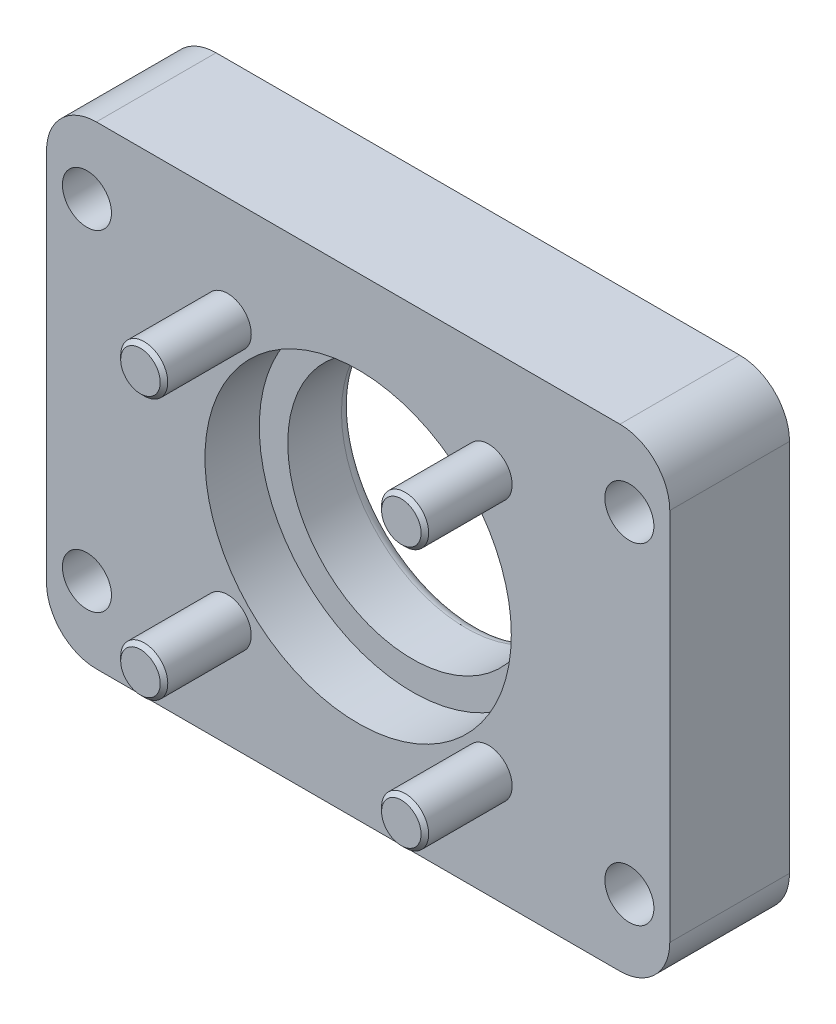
ISO-10303-21;
HEADER;
FILE_DESCRIPTION(('STEP AP214'),'2;1');
FILE_NAME('part.step','',(''),(''),'','','');
FILE_SCHEMA(('AUTOMOTIVE_DESIGN { 1 0 10303 214 1 1 1 1 }'));
ENDSEC;
DATA;
#1=APPLICATION_CONTEXT('core data for automotive mechanical design processes');
#2=APPLICATION_PROTOCOL_DEFINITION('international standard','automotive_design',2000,#1);
#3=PRODUCT_CONTEXT('',#1,'mechanical');
#4=PRODUCT('Part','Part','',(#3));
#5=PRODUCT_RELATED_PRODUCT_CATEGORY('part','',(#4));
#6=PRODUCT_DEFINITION_FORMATION('','',#4);
#7=PRODUCT_DEFINITION_CONTEXT('part definition',#1,'design');
#8=PRODUCT_DEFINITION('design','',#6,#7);
#9=PRODUCT_DEFINITION_SHAPE('','',#8);
#10=(LENGTH_UNIT() NAMED_UNIT(*) SI_UNIT(.MILLI.,.METRE.));
#11=(NAMED_UNIT(*) PLANE_ANGLE_UNIT() SI_UNIT($,.RADIAN.));
#12=(NAMED_UNIT(*) SI_UNIT($,.STERADIAN.) SOLID_ANGLE_UNIT());
#13=UNCERTAINTY_MEASURE_WITH_UNIT(LENGTH_MEASURE(1.E-05),#10,'distance_accuracy_value','');
#14=(GEOMETRIC_REPRESENTATION_CONTEXT(3) GLOBAL_UNCERTAINTY_ASSIGNED_CONTEXT((#13)) GLOBAL_UNIT_ASSIGNED_CONTEXT((#10,
#11,#12)) REPRESENTATION_CONTEXT('',''));
#15=CARTESIAN_POINT('',(0.,0.,0.));
#16=DIRECTION('',(0.,0.,1.));
#17=DIRECTION('',(1.,0.,0.));
#18=AXIS2_PLACEMENT_3D('',#15,#16,#17);
#19=CARTESIAN_POINT('',(33.2340187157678,33.2340187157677,-23.77));
#20=DIRECTION('',(0.,0.,-1.));
#21=DIRECTION('',(0.,1.,0.));
#22=AXIS2_PLACEMENT_3D('',#19,#20,#21);
#23=CONICAL_SURFACE('',#22,5.0575,1.0471975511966);
#24=CARTESIAN_POINT('',(33.2340187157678,33.2340187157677,-20.8500510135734));
#25=VERTEX_POINT('',#24);
#26=VERTEX_LOOP('',#25);
#27=FACE_BOUND('',#26,.T.);
#28=CARTESIAN_POINT('',(33.2340187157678,33.2340187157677,-23.77));
#29=DIRECTION('',(0.,0.,-1.));
#30=DIRECTION('',(0.,1.,0.));
#31=AXIS2_PLACEMENT_3D('',#28,#29,#30);
#32=CIRCLE('',#31,5.0575);
#33=CARTESIAN_POINT('',(33.2340187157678,38.2915187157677,-23.77));
#34=VERTEX_POINT('',#33);
#35=CARTESIAN_POINT('',(37.6139421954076,35.7627687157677,-23.77));
#36=VERTEX_POINT('',#35);
#37=EDGE_CURVE('E959',#34,#36,#32,.T.);
#38=ORIENTED_EDGE('',*,*,#37,.T.);
#39=CARTESIAN_POINT('',(37.6139421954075,30.7052687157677,-23.77));
#40=VERTEX_POINT('',#39);
#41=EDGE_CURVE('E962',#36,#40,#32,.T.);
#42=ORIENTED_EDGE('',*,*,#41,.T.);
#43=CARTESIAN_POINT('',(33.2340187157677,28.1765187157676,-23.77));
#44=VERTEX_POINT('',#43);
#45=EDGE_CURVE('E1276',#40,#44,#32,.T.);
#46=ORIENTED_EDGE('',*,*,#45,.T.);
#47=CARTESIAN_POINT('',(28.854095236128,30.7052687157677,-23.77));
#48=VERTEX_POINT('',#47);
#49=EDGE_CURVE('E1283',#44,#48,#32,.T.);
#50=ORIENTED_EDGE('',*,*,#49,.T.);
#51=CARTESIAN_POINT('',(28.854095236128,35.7627687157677,-23.77));
#52=VERTEX_POINT('',#51);
#53=EDGE_CURVE('E1284',#48,#52,#32,.T.);
#54=ORIENTED_EDGE('',*,*,#53,.T.);
#55=EDGE_CURVE('E963',#52,#34,#32,.T.);
#56=ORIENTED_EDGE('',*,*,#55,.T.);
#57=EDGE_LOOP('',(#38,#42,#46,#50,#54,#56));
#58=FACE_BOUND('',#57,.T.);
#59=ADVANCED_FACE('F16',(#27,#58),#23,.F.);
#60=CARTESIAN_POINT('',(-33.2340187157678,33.2340187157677,-23.77));
#61=DIRECTION('',(0.,0.,-1.));
#62=DIRECTION('',(-1.,0.,0.));
#63=AXIS2_PLACEMENT_3D('',#60,#61,#62);
#64=CONICAL_SURFACE('',#63,5.0575,1.0471975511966);
#65=CARTESIAN_POINT('',(-33.2340187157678,33.2340187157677,-20.8500510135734));
#66=VERTEX_POINT('',#65);
#67=VERTEX_LOOP('',#66);
#68=FACE_BOUND('',#67,.T.);
#69=CARTESIAN_POINT('',(-33.2340187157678,33.2340187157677,-23.77));
#70=DIRECTION('',(0.,0.,-1.));
#71=DIRECTION('',(-1.,0.,0.));
#72=AXIS2_PLACEMENT_3D('',#69,#70,#71);
#73=CIRCLE('',#72,5.0575);
#74=CARTESIAN_POINT('',(-38.2915187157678,33.2340187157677,-23.77));
#75=VERTEX_POINT('',#74);
#76=CARTESIAN_POINT('',(-35.7627687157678,37.6139421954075,-23.77));
#77=VERTEX_POINT('',#76);
#78=EDGE_CURVE('E799',#75,#77,#73,.T.);
#79=ORIENTED_EDGE('',*,*,#78,.T.);
#80=CARTESIAN_POINT('',(-30.7052687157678,37.6139421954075,-23.77));
#81=VERTEX_POINT('',#80);
#82=EDGE_CURVE('E802',#77,#81,#73,.T.);
#83=ORIENTED_EDGE('',*,*,#82,.T.);
#84=CARTESIAN_POINT('',(-28.1765187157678,33.2340187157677,-23.77));
#85=VERTEX_POINT('',#84);
#86=EDGE_CURVE('E2288',#81,#85,#73,.T.);
#87=ORIENTED_EDGE('',*,*,#86,.T.);
#88=CARTESIAN_POINT('',(-30.7052687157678,28.8540952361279,-23.77));
#89=VERTEX_POINT('',#88);
#90=EDGE_CURVE('E2291',#85,#89,#73,.T.);
#91=ORIENTED_EDGE('',*,*,#90,.T.);
#92=CARTESIAN_POINT('',(-35.7627687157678,28.8540952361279,-23.77));
#93=VERTEX_POINT('',#92);
#94=EDGE_CURVE('E2292',#89,#93,#73,.T.);
#95=ORIENTED_EDGE('',*,*,#94,.T.);
#96=EDGE_CURVE('E803',#93,#75,#73,.T.);
#97=ORIENTED_EDGE('',*,*,#96,.T.);
#98=EDGE_LOOP('',(#79,#83,#87,#91,#95,#97));
#99=FACE_BOUND('',#98,.T.);
#100=ADVANCED_FACE('F360',(#68,#99),#64,.F.);
#101=CARTESIAN_POINT('',(-33.234018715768,-33.2340187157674,-23.77));
#102=DIRECTION('',(0.,0.,-1.));
#103=DIRECTION('',(0.,-1.,0.));
#104=AXIS2_PLACEMENT_3D('',#101,#102,#103);
#105=CONICAL_SURFACE('',#104,5.0575,1.0471975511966);
#106=CARTESIAN_POINT('',(-33.234018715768,-33.2340187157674,-20.8500510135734));
#107=VERTEX_POINT('',#106);
#108=VERTEX_LOOP('',#107);
#109=FACE_BOUND('',#108,.T.);
#110=CARTESIAN_POINT('',(-33.234018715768,-33.2340187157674,-23.77));
#111=DIRECTION('',(0.,0.,-1.));
#112=DIRECTION('',(0.,-1.,0.));
#113=AXIS2_PLACEMENT_3D('',#110,#111,#112);
#114=CIRCLE('',#113,5.0575);
#115=CARTESIAN_POINT('',(-33.2340187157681,-38.2915187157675,-23.77));
#116=VERTEX_POINT('',#115);
#117=CARTESIAN_POINT('',(-37.6139421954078,-35.7627687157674,-23.77));
#118=VERTEX_POINT('',#117);
#119=EDGE_CURVE('E879',#116,#118,#114,.T.);
#120=ORIENTED_EDGE('',*,*,#119,.T.);
#121=CARTESIAN_POINT('',(-37.6139421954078,-30.7052687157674,-23.77));
#122=VERTEX_POINT('',#121);
#123=EDGE_CURVE('E882',#118,#122,#114,.T.);
#124=ORIENTED_EDGE('',*,*,#123,.T.);
#125=CARTESIAN_POINT('',(-33.234018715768,-28.1765187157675,-23.77));
#126=VERTEX_POINT('',#125);
#127=EDGE_CURVE('E2255',#122,#126,#114,.T.);
#128=ORIENTED_EDGE('',*,*,#127,.T.);
#129=CARTESIAN_POINT('',(-28.8540952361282,-30.7052687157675,-23.77));
#130=VERTEX_POINT('',#129);
#131=EDGE_CURVE('E2258',#126,#130,#114,.T.);
#132=ORIENTED_EDGE('',*,*,#131,.T.);
#133=CARTESIAN_POINT('',(-28.8540952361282,-35.7627687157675,-23.77));
#134=VERTEX_POINT('',#133);
#135=EDGE_CURVE('E2259',#130,#134,#114,.T.);
#136=ORIENTED_EDGE('',*,*,#135,.T.);
#137=EDGE_CURVE('E883',#134,#116,#114,.T.);
#138=ORIENTED_EDGE('',*,*,#137,.T.);
#139=EDGE_LOOP('',(#120,#124,#128,#132,#136,#138));
#140=FACE_BOUND('',#139,.T.);
#141=ADVANCED_FACE('F367',(#109,#140),#105,.F.);
#142=CARTESIAN_POINT('',(33.2340187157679,43.3490187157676,-23.77));
#143=DIRECTION('',(0.,0.,1.));
#144=DIRECTION('',(0.,-1.,0.));
#145=AXIS2_PLACEMENT_3D('',#142,#143,#144);
#146=PLANE('',#145);
#147=DIRECTION('',(-0.5,-0.866025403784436,0.));
#148=VECTOR('',#147,1.);
#149=CARTESIAN_POINT('',(39.0739166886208,33.2340187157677,-23.77));
#150=LINE('',#149,#148);
#151=CARTESIAN_POINT('',(36.1539677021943,28.1765187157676,-23.77));
#152=VERTEX_POINT('',#151);
#153=EDGE_CURVE('E985',#40,#152,#150,.T.);
#154=ORIENTED_EDGE('',*,*,#153,.T.);
#155=DIRECTION('',(-1.,0.,0.));
#156=VECTOR('',#155,1.);
#157=CARTESIAN_POINT('',(36.1539677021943,28.1765187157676,-23.77));
#158=LINE('',#157,#156);
#159=EDGE_CURVE('E986',#152,#44,#158,.T.);
#160=ORIENTED_EDGE('',*,*,#159,.T.);
#161=ORIENTED_EDGE('',*,*,#45,.F.);
#162=EDGE_LOOP('',(#154,#160,#161));
#163=FACE_BOUND('',#162,.T.);
#164=ADVANCED_FACE('F441',(#163),#146,.F.);
#165=CARTESIAN_POINT('',(30.3140697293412,28.1765187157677,-23.77));
#166=VERTEX_POINT('',#165);
#167=EDGE_CURVE('E988',#44,#166,#158,.T.);
#168=ORIENTED_EDGE('',*,*,#167,.T.);
#169=DIRECTION('',(0.5,-0.866025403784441,0.));
#170=VECTOR('',#169,1.);
#171=CARTESIAN_POINT('',(27.3941207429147,33.2340187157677,-23.77));
#172=LINE('',#171,#170);
#173=EDGE_CURVE('E992',#48,#166,#172,.T.);
#174=ORIENTED_EDGE('',*,*,#173,.F.);
#175=ORIENTED_EDGE('',*,*,#49,.F.);
#176=EDGE_LOOP('',(#168,#174,#175));
#177=FACE_BOUND('',#176,.T.);
#178=ADVANCED_FACE('F1230',(#177),#146,.F.);
#179=CARTESIAN_POINT('',(27.3941207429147,33.2340187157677,-23.77));
#180=VERTEX_POINT('',#179);
#181=EDGE_CURVE('E989',#180,#48,#172,.T.);
#182=ORIENTED_EDGE('',*,*,#181,.F.);
#183=DIRECTION('',(-0.5,-0.866025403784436,0.));
#184=VECTOR('',#183,1.);
#185=CARTESIAN_POINT('',(30.3140697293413,38.2915187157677,-23.77));
#186=LINE('',#185,#184);
#187=EDGE_CURVE('E996',#52,#180,#186,.T.);
#188=ORIENTED_EDGE('',*,*,#187,.F.);
#189=ORIENTED_EDGE('',*,*,#53,.F.);
#190=EDGE_LOOP('',(#182,#188,#189));
#191=FACE_BOUND('',#190,.T.);
#192=ADVANCED_FACE('F1233',(#191),#146,.F.);
#193=CARTESIAN_POINT('',(30.3140697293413,38.2915187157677,-23.77));
#194=VERTEX_POINT('',#193);
#195=EDGE_CURVE('E993',#194,#52,#186,.T.);
#196=ORIENTED_EDGE('',*,*,#195,.F.);
#197=DIRECTION('',(1.,0.,0.));
#198=VECTOR('',#197,1.);
#199=CARTESIAN_POINT('',(30.3140697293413,38.2915187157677,-23.77));
#200=LINE('',#199,#198);
#201=EDGE_CURVE('E997',#194,#34,#200,.T.);
#202=ORIENTED_EDGE('',*,*,#201,.T.);
#203=ORIENTED_EDGE('',*,*,#55,.F.);
#204=EDGE_LOOP('',(#196,#202,#203));
#205=FACE_BOUND('',#204,.T.);
#206=ADVANCED_FACE('F1289',(#205),#146,.F.);
#207=CARTESIAN_POINT('',(36.1539677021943,38.2915187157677,-23.77));
#208=VERTEX_POINT('',#207);
#209=EDGE_CURVE('E1000',#34,#208,#200,.T.);
#210=ORIENTED_EDGE('',*,*,#209,.T.);
#211=DIRECTION('',(-0.5,0.866025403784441,0.));
#212=VECTOR('',#211,1.);
#213=CARTESIAN_POINT('',(39.0739166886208,33.2340187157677,-23.77));
#214=LINE('',#213,#212);
#215=EDGE_CURVE('E1004',#36,#208,#214,.T.);
#216=ORIENTED_EDGE('',*,*,#215,.F.);
#217=ORIENTED_EDGE('',*,*,#37,.F.);
#218=EDGE_LOOP('',(#210,#216,#217));
#219=FACE_BOUND('',#218,.T.);
#220=ADVANCED_FACE('F1300',(#219),#146,.F.);
#221=CARTESIAN_POINT('',(39.0739166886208,33.2340187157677,-23.77));
#222=VERTEX_POINT('',#221);
#223=EDGE_CURVE('E1001',#222,#36,#214,.T.);
#224=ORIENTED_EDGE('',*,*,#223,.F.);
#225=EDGE_CURVE('E982',#222,#40,#150,.T.);
#226=ORIENTED_EDGE('',*,*,#225,.T.);
#227=ORIENTED_EDGE('',*,*,#41,.F.);
#228=EDGE_LOOP('',(#224,#226,#227));
#229=FACE_BOUND('',#228,.T.);
#230=ADVANCED_FACE('F1280',(#229),#146,.F.);
#231=CARTESIAN_POINT('',(-43.3490187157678,33.2340187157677,-23.77));
#232=DIRECTION('',(0.,0.,1.));
#233=DIRECTION('',(1.,0.,0.));
#234=AXIS2_PLACEMENT_3D('',#231,#232,#233);
#235=PLANE('',#234);
#236=DIRECTION('',(0.866025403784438,-0.5,0.));
#237=VECTOR('',#236,1.);
#238=CARTESIAN_POINT('',(-33.2340187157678,39.0739166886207,-23.77));
#239=LINE('',#238,#237);
#240=CARTESIAN_POINT('',(-28.1765187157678,36.1539677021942,-23.77));
#241=VERTEX_POINT('',#240);
#242=EDGE_CURVE('E825',#81,#241,#239,.T.);
#243=ORIENTED_EDGE('',*,*,#242,.T.);
#244=DIRECTION('',(0.,-1.,0.));
#245=VECTOR('',#244,1.);
#246=CARTESIAN_POINT('',(-28.1765187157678,36.1539677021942,-23.77));
#247=LINE('',#246,#245);
#248=EDGE_CURVE('E826',#241,#85,#247,.T.);
#249=ORIENTED_EDGE('',*,*,#248,.T.);
#250=ORIENTED_EDGE('',*,*,#86,.F.);
#251=EDGE_LOOP('',(#243,#249,#250));
#252=FACE_BOUND('',#251,.T.);
#253=ADVANCED_FACE('F465',(#252),#235,.F.);
#254=CARTESIAN_POINT('',(-28.1765187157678,30.3140697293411,-23.77));
#255=VERTEX_POINT('',#254);
#256=EDGE_CURVE('E828',#85,#255,#247,.T.);
#257=ORIENTED_EDGE('',*,*,#256,.T.);
#258=DIRECTION('',(0.866025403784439,0.5,0.));
#259=VECTOR('',#258,1.);
#260=CARTESIAN_POINT('',(-33.2340187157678,27.3941207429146,-23.77));
#261=LINE('',#260,#259);
#262=EDGE_CURVE('E832',#89,#255,#261,.T.);
#263=ORIENTED_EDGE('',*,*,#262,.F.);
#264=ORIENTED_EDGE('',*,*,#90,.F.);
#265=EDGE_LOOP('',(#257,#263,#264));
#266=FACE_BOUND('',#265,.T.);
#267=ADVANCED_FACE('F461',(#266),#235,.F.);
#268=CARTESIAN_POINT('',(-33.2340187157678,27.3941207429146,-23.77));
#269=VERTEX_POINT('',#268);
#270=EDGE_CURVE('E829',#269,#89,#261,.T.);
#271=ORIENTED_EDGE('',*,*,#270,.F.);
#272=DIRECTION('',(0.866025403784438,-0.5,0.));
#273=VECTOR('',#272,1.);
#274=CARTESIAN_POINT('',(-38.2915187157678,30.3140697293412,-23.77));
#275=LINE('',#274,#273);
#276=EDGE_CURVE('E836',#93,#269,#275,.T.);
#277=ORIENTED_EDGE('',*,*,#276,.F.);
#278=ORIENTED_EDGE('',*,*,#94,.F.);
#279=EDGE_LOOP('',(#271,#277,#278));
#280=FACE_BOUND('',#279,.T.);
#281=ADVANCED_FACE('F464',(#280),#235,.F.);
#282=CARTESIAN_POINT('',(-38.2915187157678,30.3140697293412,-23.77));
#283=VERTEX_POINT('',#282);
#284=EDGE_CURVE('E833',#283,#93,#275,.T.);
#285=ORIENTED_EDGE('',*,*,#284,.F.);
#286=DIRECTION('',(0.,1.,0.));
#287=VECTOR('',#286,1.);
#288=CARTESIAN_POINT('',(-38.2915187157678,30.3140697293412,-23.77));
#289=LINE('',#288,#287);
#290=EDGE_CURVE('E837',#283,#75,#289,.T.);
#291=ORIENTED_EDGE('',*,*,#290,.T.);
#292=ORIENTED_EDGE('',*,*,#96,.F.);
#293=EDGE_LOOP('',(#285,#291,#292));
#294=FACE_BOUND('',#293,.T.);
#295=ADVANCED_FACE('F1419',(#294),#235,.F.);
#296=CARTESIAN_POINT('',(-38.2915187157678,36.1539677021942,-23.77));
#297=VERTEX_POINT('',#296);
#298=EDGE_CURVE('E840',#75,#297,#289,.T.);
#299=ORIENTED_EDGE('',*,*,#298,.T.);
#300=DIRECTION('',(-0.866025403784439,-0.5,0.));
#301=VECTOR('',#300,1.);
#302=CARTESIAN_POINT('',(-33.2340187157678,39.0739166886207,-23.77));
#303=LINE('',#302,#301);
#304=EDGE_CURVE('E844',#77,#297,#303,.T.);
#305=ORIENTED_EDGE('',*,*,#304,.F.);
#306=ORIENTED_EDGE('',*,*,#78,.F.);
#307=EDGE_LOOP('',(#299,#305,#306));
#308=FACE_BOUND('',#307,.T.);
#309=ADVANCED_FACE('F1427',(#308),#235,.F.);
#310=CARTESIAN_POINT('',(-33.2340187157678,39.0739166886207,-23.77));
#311=VERTEX_POINT('',#310);
#312=EDGE_CURVE('E841',#311,#77,#303,.T.);
#313=ORIENTED_EDGE('',*,*,#312,.F.);
#314=EDGE_CURVE('E822',#311,#81,#239,.T.);
#315=ORIENTED_EDGE('',*,*,#314,.T.);
#316=ORIENTED_EDGE('',*,*,#82,.F.);
#317=EDGE_LOOP('',(#313,#315,#316));
#318=FACE_BOUND('',#317,.T.);
#319=ADVANCED_FACE('F1315',(#318),#235,.F.);
#320=CARTESIAN_POINT('',(-33.2340187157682,-43.3490187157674,-23.77));
#321=DIRECTION('',(0.,0.,1.));
#322=DIRECTION('',(0.,1.,0.));
#323=AXIS2_PLACEMENT_3D('',#320,#321,#322);
#324=PLANE('',#323);
#325=DIRECTION('',(0.50000000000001,0.866025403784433,0.));
#326=VECTOR('',#325,1.);
#327=CARTESIAN_POINT('',(-39.073916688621,-33.2340187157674,-23.77));
#328=LINE('',#327,#326);
#329=CARTESIAN_POINT('',(-36.1539677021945,-28.1765187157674,-23.77));
#330=VERTEX_POINT('',#329);
#331=EDGE_CURVE('E905',#122,#330,#328,.T.);
#332=ORIENTED_EDGE('',*,*,#331,.T.);
#333=DIRECTION('',(1.,0.,0.));
#334=VECTOR('',#333,1.);
#335=CARTESIAN_POINT('',(-36.1539677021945,-28.1765187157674,-23.77));
#336=LINE('',#335,#334);
#337=EDGE_CURVE('E906',#330,#126,#336,.T.);
#338=ORIENTED_EDGE('',*,*,#337,.T.);
#339=ORIENTED_EDGE('',*,*,#127,.F.);
#340=EDGE_LOOP('',(#332,#338,#339));
#341=FACE_BOUND('',#340,.T.);
#342=ADVANCED_FACE('F413',(#341),#324,.F.);
#343=CARTESIAN_POINT('',(-30.3140697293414,-28.1765187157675,-23.77));
#344=VERTEX_POINT('',#343);
#345=EDGE_CURVE('E908',#126,#344,#336,.T.);
#346=ORIENTED_EDGE('',*,*,#345,.T.);
#347=DIRECTION('',(-0.49999999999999,0.866025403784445,0.));
#348=VECTOR('',#347,1.);
#349=CARTESIAN_POINT('',(-27.394120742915,-33.2340187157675,-23.77));
#350=LINE('',#349,#348);
#351=EDGE_CURVE('E912',#130,#344,#350,.T.);
#352=ORIENTED_EDGE('',*,*,#351,.F.);
#353=ORIENTED_EDGE('',*,*,#131,.F.);
#354=EDGE_LOOP('',(#346,#352,#353));
#355=FACE_BOUND('',#354,.T.);
#356=ADVANCED_FACE('F409',(#355),#324,.F.);
#357=CARTESIAN_POINT('',(-27.394120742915,-33.2340187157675,-23.77));
#358=VERTEX_POINT('',#357);
#359=EDGE_CURVE('E909',#358,#130,#350,.T.);
#360=ORIENTED_EDGE('',*,*,#359,.F.);
#361=DIRECTION('',(0.50000000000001,0.866025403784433,0.));
#362=VECTOR('',#361,1.);
#363=CARTESIAN_POINT('',(-30.3140697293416,-38.2915187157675,-23.77));
#364=LINE('',#363,#362);
#365=EDGE_CURVE('E916',#134,#358,#364,.T.);
#366=ORIENTED_EDGE('',*,*,#365,.F.);
#367=ORIENTED_EDGE('',*,*,#135,.F.);
#368=EDGE_LOOP('',(#360,#366,#367));
#369=FACE_BOUND('',#368,.T.);
#370=ADVANCED_FACE('F412',(#369),#324,.F.);
#371=CARTESIAN_POINT('',(-30.3140697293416,-38.2915187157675,-23.77));
#372=VERTEX_POINT('',#371);
#373=EDGE_CURVE('E913',#372,#134,#364,.T.);
#374=ORIENTED_EDGE('',*,*,#373,.F.);
#375=DIRECTION('',(-1.,0.,0.));
#376=VECTOR('',#375,1.);
#377=CARTESIAN_POINT('',(-30.3140697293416,-38.2915187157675,-23.77));
#378=LINE('',#377,#376);
#379=EDGE_CURVE('E917',#372,#116,#378,.T.);
#380=ORIENTED_EDGE('',*,*,#379,.T.);
#381=ORIENTED_EDGE('',*,*,#137,.F.);
#382=EDGE_LOOP('',(#374,#380,#381));
#383=FACE_BOUND('',#382,.T.);
#384=ADVANCED_FACE('F1463',(#383),#324,.F.);
#385=CARTESIAN_POINT('',(-36.1539677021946,-38.2915187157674,-23.77));
#386=VERTEX_POINT('',#385);
#387=EDGE_CURVE('E920',#116,#386,#378,.T.);
#388=ORIENTED_EDGE('',*,*,#387,.T.);
#389=DIRECTION('',(0.49999999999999,-0.866025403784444,0.));
#390=VECTOR('',#389,1.);
#391=CARTESIAN_POINT('',(-39.073916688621,-33.2340187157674,-23.77));
#392=LINE('',#391,#390);
#393=EDGE_CURVE('E924',#118,#386,#392,.T.);
#394=ORIENTED_EDGE('',*,*,#393,.F.);
#395=ORIENTED_EDGE('',*,*,#119,.F.);
#396=EDGE_LOOP('',(#388,#394,#395));
#397=FACE_BOUND('',#396,.T.);
#398=ADVANCED_FACE('F1471',(#397),#324,.F.);
#399=CARTESIAN_POINT('',(-39.073916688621,-33.2340187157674,-23.77));
#400=VERTEX_POINT('',#399);
#401=EDGE_CURVE('E921',#400,#118,#392,.T.);
#402=ORIENTED_EDGE('',*,*,#401,.F.);
#403=EDGE_CURVE('E902',#400,#122,#328,.T.);
#404=ORIENTED_EDGE('',*,*,#403,.T.);
#405=ORIENTED_EDGE('',*,*,#123,.F.);
#406=EDGE_LOOP('',(#402,#404,#405));
#407=FACE_BOUND('',#406,.T.);
#408=ADVANCED_FACE('F1239',(#407),#324,.F.);
#409=CARTESIAN_POINT('',(39.0739166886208,33.2340187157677,-23.77));
#410=DIRECTION('',(0.866025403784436,-0.5,0.));
#411=DIRECTION('',(0.5,0.866025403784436,0.));
#412=AXIS2_PLACEMENT_3D('',#409,#410,#411);
#413=PLANE('',#412);
#414=DIRECTION('',(-0.5,-0.866025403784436,0.));
#415=VECTOR('',#414,1.);
#416=CARTESIAN_POINT('',(39.0739166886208,33.2340187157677,-29.77));
#417=LINE('',#416,#415);
#418=CARTESIAN_POINT('',(39.0739166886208,33.2340187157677,-29.77));
#419=VERTEX_POINT('',#418);
#420=CARTESIAN_POINT('',(36.1539677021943,28.1765187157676,-29.77));
#421=VERTEX_POINT('',#420);
#422=EDGE_CURVE('E1005',#419,#421,#417,.T.);
#423=ORIENTED_EDGE('',*,*,#422,.T.);
#424=DIRECTION('',(0.,0.,-1.));
#425=VECTOR('',#424,1.);
#426=CARTESIAN_POINT('',(36.1539677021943,28.1765187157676,-23.77));
#427=LINE('',#426,#425);
#428=EDGE_CURVE('E976',#152,#421,#427,.T.);
#429=ORIENTED_EDGE('',*,*,#428,.F.);
#430=ORIENTED_EDGE('',*,*,#153,.F.);
#431=ORIENTED_EDGE('',*,*,#225,.F.);
#432=DIRECTION('',(0.,0.,-1.));
#433=VECTOR('',#432,1.);
#434=CARTESIAN_POINT('',(39.0739166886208,33.2340187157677,-23.77));
#435=LINE('',#434,#433);
#436=EDGE_CURVE('E979',#222,#419,#435,.T.);
#437=ORIENTED_EDGE('',*,*,#436,.T.);
#438=EDGE_LOOP('',(#423,#429,#430,#431,#437));
#439=FACE_BOUND('',#438,.T.);
#440=ADVANCED_FACE('F1235',(#439),#413,.F.);
#441=CARTESIAN_POINT('',(36.1539677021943,28.1765187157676,-23.77));
#442=DIRECTION('',(0.,-1.,0.));
#443=DIRECTION('',(1.,0.,0.));
#444=AXIS2_PLACEMENT_3D('',#441,#442,#443);
#445=PLANE('',#444);
#446=DIRECTION('',(-1.,0.,0.));
#447=VECTOR('',#446,1.);
#448=CARTESIAN_POINT('',(36.1539677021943,28.1765187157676,-29.77));
#449=LINE('',#448,#447);
#450=CARTESIAN_POINT('',(30.3140697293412,28.1765187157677,-29.77));
#451=VERTEX_POINT('',#450);
#452=EDGE_CURVE('E1008',#421,#451,#449,.T.);
#453=ORIENTED_EDGE('',*,*,#452,.T.);
#454=DIRECTION('',(0.,0.,-1.));
#455=VECTOR('',#454,1.);
#456=CARTESIAN_POINT('',(30.3140697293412,28.1765187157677,-23.77));
#457=LINE('',#456,#455);
#458=EDGE_CURVE('E973',#166,#451,#457,.T.);
#459=ORIENTED_EDGE('',*,*,#458,.F.);
#460=ORIENTED_EDGE('',*,*,#167,.F.);
#461=ORIENTED_EDGE('',*,*,#159,.F.);
#462=ORIENTED_EDGE('',*,*,#428,.T.);
#463=EDGE_LOOP('',(#453,#459,#460,#461,#462));
#464=FACE_BOUND('',#463,.T.);
#465=ADVANCED_FACE('F1238',(#464),#445,.F.);
#466=CARTESIAN_POINT('',(27.3941207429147,33.2340187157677,-23.77));
#467=DIRECTION('',(0.866025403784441,0.5,0.));
#468=DIRECTION('',(-0.5,0.866025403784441,0.));
#469=AXIS2_PLACEMENT_3D('',#466,#467,#468);
#470=PLANE('',#469);
#471=DIRECTION('',(0.5,-0.866025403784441,0.));
#472=VECTOR('',#471,1.);
#473=CARTESIAN_POINT('',(27.3941207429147,33.2340187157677,-29.77));
#474=LINE('',#473,#472);
#475=CARTESIAN_POINT('',(27.3941207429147,33.2340187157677,-29.77));
#476=VERTEX_POINT('',#475);
#477=EDGE_CURVE('E1010',#476,#451,#474,.T.);
#478=ORIENTED_EDGE('',*,*,#477,.F.);
#479=DIRECTION('',(0.,0.,-1.));
#480=VECTOR('',#479,1.);
#481=CARTESIAN_POINT('',(27.3941207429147,33.2340187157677,-23.77));
#482=LINE('',#481,#480);
#483=EDGE_CURVE('E970',#180,#476,#482,.T.);
#484=ORIENTED_EDGE('',*,*,#483,.F.);
#485=ORIENTED_EDGE('',*,*,#181,.T.);
#486=ORIENTED_EDGE('',*,*,#173,.T.);
#487=ORIENTED_EDGE('',*,*,#458,.T.);
#488=EDGE_LOOP('',(#478,#484,#485,#486,#487));
#489=FACE_BOUND('',#488,.T.);
#490=ADVANCED_FACE('F1243',(#489),#470,.T.);
#491=CARTESIAN_POINT('',(30.3140697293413,38.2915187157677,-23.77));
#492=DIRECTION('',(0.866025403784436,-0.5,0.));
#493=DIRECTION('',(0.5,0.866025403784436,0.));
#494=AXIS2_PLACEMENT_3D('',#491,#492,#493);
#495=PLANE('',#494);
#496=DIRECTION('',(-0.5,-0.866025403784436,0.));
#497=VECTOR('',#496,1.);
#498=CARTESIAN_POINT('',(30.3140697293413,38.2915187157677,-29.77));
#499=LINE('',#498,#497);
#500=CARTESIAN_POINT('',(30.3140697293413,38.2915187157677,-29.77));
#501=VERTEX_POINT('',#500);
#502=EDGE_CURVE('E1013',#501,#476,#499,.T.);
#503=ORIENTED_EDGE('',*,*,#502,.F.);
#504=DIRECTION('',(0.,0.,-1.));
#505=VECTOR('',#504,1.);
#506=CARTESIAN_POINT('',(30.3140697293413,38.2915187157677,-23.77));
#507=LINE('',#506,#505);
#508=EDGE_CURVE('E967',#194,#501,#507,.T.);
#509=ORIENTED_EDGE('',*,*,#508,.F.);
#510=ORIENTED_EDGE('',*,*,#195,.T.);
#511=ORIENTED_EDGE('',*,*,#187,.T.);
#512=ORIENTED_EDGE('',*,*,#483,.T.);
#513=EDGE_LOOP('',(#503,#509,#510,#511,#512));
#514=FACE_BOUND('',#513,.T.);
#515=ADVANCED_FACE('F1247',(#514),#495,.T.);
#516=CARTESIAN_POINT('',(30.3140697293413,38.2915187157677,-23.77));
#517=DIRECTION('',(0.,1.,0.));
#518=DIRECTION('',(-1.,0.,0.));
#519=AXIS2_PLACEMENT_3D('',#516,#517,#518);
#520=PLANE('',#519);
#521=DIRECTION('',(1.,0.,0.));
#522=VECTOR('',#521,1.);
#523=CARTESIAN_POINT('',(30.3140697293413,38.2915187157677,-29.77));
#524=LINE('',#523,#522);
#525=CARTESIAN_POINT('',(36.1539677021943,38.2915187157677,-29.77));
#526=VERTEX_POINT('',#525);
#527=EDGE_CURVE('E1016',#501,#526,#524,.T.);
#528=ORIENTED_EDGE('',*,*,#527,.T.);
#529=DIRECTION('',(0.,0.,-1.));
#530=VECTOR('',#529,1.);
#531=CARTESIAN_POINT('',(36.1539677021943,38.2915187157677,-23.77));
#532=LINE('',#531,#530);
#533=EDGE_CURVE('E964',#208,#526,#532,.T.);
#534=ORIENTED_EDGE('',*,*,#533,.F.);
#535=ORIENTED_EDGE('',*,*,#209,.F.);
#536=ORIENTED_EDGE('',*,*,#201,.F.);
#537=ORIENTED_EDGE('',*,*,#508,.T.);
#538=EDGE_LOOP('',(#528,#534,#535,#536,#537));
#539=FACE_BOUND('',#538,.T.);
#540=ADVANCED_FACE('F1250',(#539),#520,.F.);
#541=CARTESIAN_POINT('',(39.0739166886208,33.2340187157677,-23.77));
#542=DIRECTION('',(-0.866025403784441,-0.5,0.));
#543=DIRECTION('',(0.5,-0.866025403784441,0.));
#544=AXIS2_PLACEMENT_3D('',#541,#542,#543);
#545=PLANE('',#544);
#546=DIRECTION('',(-0.5,0.866025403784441,0.));
#547=VECTOR('',#546,1.);
#548=CARTESIAN_POINT('',(39.0739166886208,33.2340187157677,-29.77));
#549=LINE('',#548,#547);
#550=EDGE_CURVE('E863',#419,#526,#549,.T.);
#551=ORIENTED_EDGE('',*,*,#550,.F.);
#552=ORIENTED_EDGE('',*,*,#436,.F.);
#553=ORIENTED_EDGE('',*,*,#223,.T.);
#554=ORIENTED_EDGE('',*,*,#215,.T.);
#555=ORIENTED_EDGE('',*,*,#533,.T.);
#556=EDGE_LOOP('',(#551,#552,#553,#554,#555));
#557=FACE_BOUND('',#556,.T.);
#558=ADVANCED_FACE('F373',(#557),#545,.T.);
#559=CARTESIAN_POINT('',(-33.2340187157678,39.0739166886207,-23.77));
#560=DIRECTION('',(0.5,0.866025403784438,0.));
#561=DIRECTION('',(-0.866025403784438,0.5,0.));
#562=AXIS2_PLACEMENT_3D('',#559,#560,#561);
#563=PLANE('',#562);
#564=DIRECTION('',(0.866025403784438,-0.5,0.));
#565=VECTOR('',#564,1.);
#566=CARTESIAN_POINT('',(-33.2340187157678,39.0739166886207,-29.77));
#567=LINE('',#566,#565);
#568=CARTESIAN_POINT('',(-33.2340187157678,39.0739166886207,-29.77));
#569=VERTEX_POINT('',#568);
#570=CARTESIAN_POINT('',(-28.1765187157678,36.1539677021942,-29.77));
#571=VERTEX_POINT('',#570);
#572=EDGE_CURVE('E845',#569,#571,#567,.T.);
#573=ORIENTED_EDGE('',*,*,#572,.T.);
#574=DIRECTION('',(0.,0.,-1.));
#575=VECTOR('',#574,1.);
#576=CARTESIAN_POINT('',(-28.1765187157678,36.1539677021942,-23.77));
#577=LINE('',#576,#575);
#578=EDGE_CURVE('E816',#241,#571,#577,.T.);
#579=ORIENTED_EDGE('',*,*,#578,.F.);
#580=ORIENTED_EDGE('',*,*,#242,.F.);
#581=ORIENTED_EDGE('',*,*,#314,.F.);
#582=DIRECTION('',(0.,0.,-1.));
#583=VECTOR('',#582,1.);
#584=CARTESIAN_POINT('',(-33.2340187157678,39.0739166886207,-23.77));
#585=LINE('',#584,#583);
#586=EDGE_CURVE('E819',#311,#569,#585,.T.);
#587=ORIENTED_EDGE('',*,*,#586,.T.);
#588=EDGE_LOOP('',(#573,#579,#580,#581,#587));
#589=FACE_BOUND('',#588,.T.);
#590=ADVANCED_FACE('F467',(#589),#563,.F.);
#591=CARTESIAN_POINT('',(-28.1765187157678,36.1539677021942,-23.77));
#592=DIRECTION('',(1.,0.,0.));
#593=DIRECTION('',(0.,1.,0.));
#594=AXIS2_PLACEMENT_3D('',#591,#592,#593);
#595=PLANE('',#594);
#596=DIRECTION('',(0.,-1.,0.));
#597=VECTOR('',#596,1.);
#598=CARTESIAN_POINT('',(-28.1765187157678,36.1539677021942,-29.77));
#599=LINE('',#598,#597);
#600=CARTESIAN_POINT('',(-28.1765187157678,30.3140697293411,-29.77));
#601=VERTEX_POINT('',#600);
#602=EDGE_CURVE('E848',#571,#601,#599,.T.);
#603=ORIENTED_EDGE('',*,*,#602,.T.);
#604=DIRECTION('',(0.,0.,-1.));
#605=VECTOR('',#604,1.);
#606=CARTESIAN_POINT('',(-28.1765187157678,30.3140697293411,-23.77));
#607=LINE('',#606,#605);
#608=EDGE_CURVE('E813',#255,#601,#607,.T.);
#609=ORIENTED_EDGE('',*,*,#608,.F.);
#610=ORIENTED_EDGE('',*,*,#256,.F.);
#611=ORIENTED_EDGE('',*,*,#248,.F.);
#612=ORIENTED_EDGE('',*,*,#578,.T.);
#613=EDGE_LOOP('',(#603,#609,#610,#611,#612));
#614=FACE_BOUND('',#613,.T.);
#615=ADVANCED_FACE('F470',(#614),#595,.F.);
#616=CARTESIAN_POINT('',(-33.2340187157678,27.3941207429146,-23.77));
#617=DIRECTION('',(-0.5,0.866025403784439,0.));
#618=DIRECTION('',(-0.866025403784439,-0.5,0.));
#619=AXIS2_PLACEMENT_3D('',#616,#617,#618);
#620=PLANE('',#619);
#621=DIRECTION('',(0.866025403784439,0.5,0.));
#622=VECTOR('',#621,1.);
#623=CARTESIAN_POINT('',(-33.2340187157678,27.3941207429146,-29.77));
#624=LINE('',#623,#622);
#625=CARTESIAN_POINT('',(-33.2340187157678,27.3941207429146,-29.77));
#626=VERTEX_POINT('',#625);
#627=EDGE_CURVE('E850',#626,#601,#624,.T.);
#628=ORIENTED_EDGE('',*,*,#627,.F.);
#629=DIRECTION('',(0.,0.,-1.));
#630=VECTOR('',#629,1.);
#631=CARTESIAN_POINT('',(-33.2340187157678,27.3941207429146,-23.77));
#632=LINE('',#631,#630);
#633=EDGE_CURVE('E810',#269,#626,#632,.T.);
#634=ORIENTED_EDGE('',*,*,#633,.F.);
#635=ORIENTED_EDGE('',*,*,#270,.T.);
#636=ORIENTED_EDGE('',*,*,#262,.T.);
#637=ORIENTED_EDGE('',*,*,#608,.T.);
#638=EDGE_LOOP('',(#628,#634,#635,#636,#637));
#639=FACE_BOUND('',#638,.T.);
#640=ADVANCED_FACE('F474',(#639),#620,.T.);
#641=CARTESIAN_POINT('',(-38.2915187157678,30.3140697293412,-23.77));
#642=DIRECTION('',(0.5,0.866025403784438,0.));
#643=DIRECTION('',(-0.866025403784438,0.5,0.));
#644=AXIS2_PLACEMENT_3D('',#641,#642,#643);
#645=PLANE('',#644);
#646=DIRECTION('',(0.866025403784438,-0.5,0.));
#647=VECTOR('',#646,1.);
#648=CARTESIAN_POINT('',(-38.2915187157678,30.3140697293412,-29.77));
#649=LINE('',#648,#647);
#650=CARTESIAN_POINT('',(-38.2915187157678,30.3140697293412,-29.77));
#651=VERTEX_POINT('',#650);
#652=EDGE_CURVE('E853',#651,#626,#649,.T.);
#653=ORIENTED_EDGE('',*,*,#652,.F.);
#654=DIRECTION('',(0.,0.,-1.));
#655=VECTOR('',#654,1.);
#656=CARTESIAN_POINT('',(-38.2915187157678,30.3140697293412,-23.77));
#657=LINE('',#656,#655);
#658=EDGE_CURVE('E807',#283,#651,#657,.T.);
#659=ORIENTED_EDGE('',*,*,#658,.F.);
#660=ORIENTED_EDGE('',*,*,#284,.T.);
#661=ORIENTED_EDGE('',*,*,#276,.T.);
#662=ORIENTED_EDGE('',*,*,#633,.T.);
#663=EDGE_LOOP('',(#653,#659,#660,#661,#662));
#664=FACE_BOUND('',#663,.T.);
#665=ADVANCED_FACE('F478',(#664),#645,.T.);
#666=CARTESIAN_POINT('',(-38.2915187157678,30.3140697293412,-23.77));
#667=DIRECTION('',(-1.,0.,0.));
#668=DIRECTION('',(0.,-1.,0.));
#669=AXIS2_PLACEMENT_3D('',#666,#667,#668);
#670=PLANE('',#669);
#671=DIRECTION('',(0.,1.,0.));
#672=VECTOR('',#671,1.);
#673=CARTESIAN_POINT('',(-38.2915187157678,30.3140697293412,-29.77));
#674=LINE('',#673,#672);
#675=CARTESIAN_POINT('',(-38.2915187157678,36.1539677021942,-29.77));
#676=VERTEX_POINT('',#675);
#677=EDGE_CURVE('E856',#651,#676,#674,.T.);
#678=ORIENTED_EDGE('',*,*,#677,.T.);
#679=DIRECTION('',(0.,0.,-1.));
#680=VECTOR('',#679,1.);
#681=CARTESIAN_POINT('',(-38.2915187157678,36.1539677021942,-23.77));
#682=LINE('',#681,#680);
#683=EDGE_CURVE('E804',#297,#676,#682,.T.);
#684=ORIENTED_EDGE('',*,*,#683,.F.);
#685=ORIENTED_EDGE('',*,*,#298,.F.);
#686=ORIENTED_EDGE('',*,*,#290,.F.);
#687=ORIENTED_EDGE('',*,*,#658,.T.);
#688=EDGE_LOOP('',(#678,#684,#685,#686,#687));
#689=FACE_BOUND('',#688,.T.);
#690=ADVANCED_FACE('F482',(#689),#670,.F.);
#691=CARTESIAN_POINT('',(-33.2340187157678,39.0739166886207,-23.77));
#692=DIRECTION('',(0.5,-0.866025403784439,0.));
#693=DIRECTION('',(0.866025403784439,0.5,0.));
#694=AXIS2_PLACEMENT_3D('',#691,#692,#693);
#695=PLANE('',#694);
#696=DIRECTION('',(-0.866025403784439,-0.5,0.));
#697=VECTOR('',#696,1.);
#698=CARTESIAN_POINT('',(-33.2340187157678,39.0739166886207,-29.77));
#699=LINE('',#698,#697);
#700=EDGE_CURVE('E319',#569,#676,#699,.T.);
#701=ORIENTED_EDGE('',*,*,#700,.F.);
#702=ORIENTED_EDGE('',*,*,#586,.F.);
#703=ORIENTED_EDGE('',*,*,#312,.T.);
#704=ORIENTED_EDGE('',*,*,#304,.T.);
#705=ORIENTED_EDGE('',*,*,#683,.T.);
#706=EDGE_LOOP('',(#701,#702,#703,#704,#705));
#707=FACE_BOUND('',#706,.T.);
#708=ADVANCED_FACE('F419',(#707),#695,.T.);
#709=CARTESIAN_POINT('',(-39.073916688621,-33.2340187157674,-23.77));
#710=DIRECTION('',(-0.866025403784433,0.50000000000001,0.));
#711=DIRECTION('',(-0.50000000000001,-0.866025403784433,0.));
#712=AXIS2_PLACEMENT_3D('',#709,#710,#711);
#713=PLANE('',#712);
#714=DIRECTION('',(0.50000000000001,0.866025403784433,0.));
#715=VECTOR('',#714,1.);
#716=CARTESIAN_POINT('',(-39.073916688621,-33.2340187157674,-29.77));
#717=LINE('',#716,#715);
#718=CARTESIAN_POINT('',(-39.073916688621,-33.2340187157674,-29.77));
#719=VERTEX_POINT('',#718);
#720=CARTESIAN_POINT('',(-36.1539677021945,-28.1765187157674,-29.77));
#721=VERTEX_POINT('',#720);
#722=EDGE_CURVE('E925',#719,#721,#717,.T.);
#723=ORIENTED_EDGE('',*,*,#722,.T.);
#724=DIRECTION('',(0.,0.,-1.));
#725=VECTOR('',#724,1.);
#726=CARTESIAN_POINT('',(-36.1539677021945,-28.1765187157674,-23.77));
#727=LINE('',#726,#725);
#728=EDGE_CURVE('E896',#330,#721,#727,.T.);
#729=ORIENTED_EDGE('',*,*,#728,.F.);
#730=ORIENTED_EDGE('',*,*,#331,.F.);
#731=ORIENTED_EDGE('',*,*,#403,.F.);
#732=DIRECTION('',(0.,0.,-1.));
#733=VECTOR('',#732,1.);
#734=CARTESIAN_POINT('',(-39.073916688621,-33.2340187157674,-23.77));
#735=LINE('',#734,#733);
#736=EDGE_CURVE('E899',#400,#719,#735,.T.);
#737=ORIENTED_EDGE('',*,*,#736,.T.);
#738=EDGE_LOOP('',(#723,#729,#730,#731,#737));
#739=FACE_BOUND('',#738,.T.);
#740=ADVANCED_FACE('F415',(#739),#713,.F.);
#741=CARTESIAN_POINT('',(-36.1539677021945,-28.1765187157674,-23.77));
#742=DIRECTION('',(0.,1.,0.));
#743=DIRECTION('',(-1.,0.,0.));
#744=AXIS2_PLACEMENT_3D('',#741,#742,#743);
#745=PLANE('',#744);
#746=DIRECTION('',(1.,0.,0.));
#747=VECTOR('',#746,1.);
#748=CARTESIAN_POINT('',(-36.1539677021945,-28.1765187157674,-29.77));
#749=LINE('',#748,#747);
#750=CARTESIAN_POINT('',(-30.3140697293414,-28.1765187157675,-29.77));
#751=VERTEX_POINT('',#750);
#752=EDGE_CURVE('E928',#721,#751,#749,.T.);
#753=ORIENTED_EDGE('',*,*,#752,.T.);
#754=DIRECTION('',(0.,0.,-1.));
#755=VECTOR('',#754,1.);
#756=CARTESIAN_POINT('',(-30.3140697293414,-28.1765187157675,-23.77));
#757=LINE('',#756,#755);
#758=EDGE_CURVE('E893',#344,#751,#757,.T.);
#759=ORIENTED_EDGE('',*,*,#758,.F.);
#760=ORIENTED_EDGE('',*,*,#345,.F.);
#761=ORIENTED_EDGE('',*,*,#337,.F.);
#762=ORIENTED_EDGE('',*,*,#728,.T.);
#763=EDGE_LOOP('',(#753,#759,#760,#761,#762));
#764=FACE_BOUND('',#763,.T.);
#765=ADVANCED_FACE('F418',(#764),#745,.F.);
#766=CARTESIAN_POINT('',(-27.394120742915,-33.2340187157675,-23.77));
#767=DIRECTION('',(-0.866025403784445,-0.49999999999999,0.));
#768=DIRECTION('',(0.49999999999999,-0.866025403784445,0.));
#769=AXIS2_PLACEMENT_3D('',#766,#767,#768);
#770=PLANE('',#769);
#771=DIRECTION('',(-0.49999999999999,0.866025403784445,0.));
#772=VECTOR('',#771,1.);
#773=CARTESIAN_POINT('',(-27.394120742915,-33.2340187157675,-29.77));
#774=LINE('',#773,#772);
#775=CARTESIAN_POINT('',(-27.394120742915,-33.2340187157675,-29.77));
#776=VERTEX_POINT('',#775);
#777=EDGE_CURVE('E930',#776,#751,#774,.T.);
#778=ORIENTED_EDGE('',*,*,#777,.F.);
#779=DIRECTION('',(0.,0.,-1.));
#780=VECTOR('',#779,1.);
#781=CARTESIAN_POINT('',(-27.394120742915,-33.2340187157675,-23.77));
#782=LINE('',#781,#780);
#783=EDGE_CURVE('E890',#358,#776,#782,.T.);
#784=ORIENTED_EDGE('',*,*,#783,.F.);
#785=ORIENTED_EDGE('',*,*,#359,.T.);
#786=ORIENTED_EDGE('',*,*,#351,.T.);
#787=ORIENTED_EDGE('',*,*,#758,.T.);
#788=EDGE_LOOP('',(#778,#784,#785,#786,#787));
#789=FACE_BOUND('',#788,.T.);
#790=ADVANCED_FACE('F423',(#789),#770,.T.);
#791=CARTESIAN_POINT('',(-30.3140697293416,-38.2915187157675,-23.77));
#792=DIRECTION('',(-0.866025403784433,0.50000000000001,0.));
#793=DIRECTION('',(-0.50000000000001,-0.866025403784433,0.));
#794=AXIS2_PLACEMENT_3D('',#791,#792,#793);
#795=PLANE('',#794);
#796=DIRECTION('',(0.50000000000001,0.866025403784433,0.));
#797=VECTOR('',#796,1.);
#798=CARTESIAN_POINT('',(-30.3140697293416,-38.2915187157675,-29.77));
#799=LINE('',#798,#797);
#800=CARTESIAN_POINT('',(-30.3140697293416,-38.2915187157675,-29.77));
#801=VERTEX_POINT('',#800);
#802=EDGE_CURVE('E933',#801,#776,#799,.T.);
#803=ORIENTED_EDGE('',*,*,#802,.F.);
#804=DIRECTION('',(0.,0.,-1.));
#805=VECTOR('',#804,1.);
#806=CARTESIAN_POINT('',(-30.3140697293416,-38.2915187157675,-23.77));
#807=LINE('',#806,#805);
#808=EDGE_CURVE('E887',#372,#801,#807,.T.);
#809=ORIENTED_EDGE('',*,*,#808,.F.);
#810=ORIENTED_EDGE('',*,*,#373,.T.);
#811=ORIENTED_EDGE('',*,*,#365,.T.);
#812=ORIENTED_EDGE('',*,*,#783,.T.);
#813=EDGE_LOOP('',(#803,#809,#810,#811,#812));
#814=FACE_BOUND('',#813,.T.);
#815=ADVANCED_FACE('F427',(#814),#795,.T.);
#816=CARTESIAN_POINT('',(-30.3140697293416,-38.2915187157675,-23.77));
#817=DIRECTION('',(0.,-1.,0.));
#818=DIRECTION('',(1.,0.,0.));
#819=AXIS2_PLACEMENT_3D('',#816,#817,#818);
#820=PLANE('',#819);
#821=DIRECTION('',(-1.,0.,0.));
#822=VECTOR('',#821,1.);
#823=CARTESIAN_POINT('',(-30.3140697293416,-38.2915187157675,-29.77));
#824=LINE('',#823,#822);
#825=CARTESIAN_POINT('',(-36.1539677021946,-38.2915187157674,-29.77));
#826=VERTEX_POINT('',#825);
#827=EDGE_CURVE('E936',#801,#826,#824,.T.);
#828=ORIENTED_EDGE('',*,*,#827,.T.);
#829=DIRECTION('',(0.,0.,-1.));
#830=VECTOR('',#829,1.);
#831=CARTESIAN_POINT('',(-36.1539677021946,-38.2915187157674,-23.77));
#832=LINE('',#831,#830);
#833=EDGE_CURVE('E884',#386,#826,#832,.T.);
#834=ORIENTED_EDGE('',*,*,#833,.F.);
#835=ORIENTED_EDGE('',*,*,#387,.F.);
#836=ORIENTED_EDGE('',*,*,#379,.F.);
#837=ORIENTED_EDGE('',*,*,#808,.T.);
#838=EDGE_LOOP('',(#828,#834,#835,#836,#837));
#839=FACE_BOUND('',#838,.T.);
#840=ADVANCED_FACE('F431',(#839),#820,.F.);
#841=CARTESIAN_POINT('',(-39.073916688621,-33.2340187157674,-23.77));
#842=DIRECTION('',(0.866025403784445,0.49999999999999,0.));
#843=DIRECTION('',(-0.49999999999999,0.866025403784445,0.));
#844=AXIS2_PLACEMENT_3D('',#841,#842,#843);
#845=PLANE('',#844);
#846=DIRECTION('',(0.49999999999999,-0.866025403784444,0.));
#847=VECTOR('',#846,1.);
#848=CARTESIAN_POINT('',(-39.073916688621,-33.2340187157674,-29.77));
#849=LINE('',#848,#847);
#850=EDGE_CURVE('E783',#719,#826,#849,.T.);
#851=ORIENTED_EDGE('',*,*,#850,.F.);
#852=ORIENTED_EDGE('',*,*,#736,.F.);
#853=ORIENTED_EDGE('',*,*,#401,.T.);
#854=ORIENTED_EDGE('',*,*,#393,.T.);
#855=ORIENTED_EDGE('',*,*,#833,.T.);
#856=EDGE_LOOP('',(#851,#852,#853,#854,#855));
#857=FACE_BOUND('',#856,.T.);
#858=ADVANCED_FACE('F407',(#857),#845,.T.);
#859=CARTESIAN_POINT('',(33.2340187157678,33.2340187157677,-29.77));
#860=DIRECTION('',(0.,0.,-1.));
#861=DIRECTION('',(0.,1.,0.));
#862=AXIS2_PLACEMENT_3D('',#859,#860,#861);
#863=PLANE('',#862);
#864=ORIENTED_EDGE('',*,*,#550,.T.);
#865=ORIENTED_EDGE('',*,*,#527,.F.);
#866=ORIENTED_EDGE('',*,*,#502,.T.);
#867=ORIENTED_EDGE('',*,*,#477,.T.);
#868=ORIENTED_EDGE('',*,*,#452,.F.);
#869=ORIENTED_EDGE('',*,*,#422,.F.);
#870=EDGE_LOOP('',(#864,#865,#866,#867,#868,#869));
#871=FACE_BOUND('',#870,.T.);
#872=CARTESIAN_POINT('',(33.2340187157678,33.2340187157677,-29.77));
#873=DIRECTION('',(0.,0.,-1.));
#874=DIRECTION('',(0.,1.,0.));
#875=AXIS2_PLACEMENT_3D('',#872,#873,#874);
#876=CIRCLE('',#875,7.8);
#877=CARTESIAN_POINT('',(33.2340187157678,41.0340187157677,-29.77));
#878=VERTEX_POINT('',#877);
#879=EDGE_CURVE('E944',#878,#878,#876,.T.);
#880=ORIENTED_EDGE('',*,*,#879,.T.);
#881=EDGE_LOOP('',(#880));
#882=FACE_BOUND('',#881,.T.);
#883=ADVANCED_FACE('F403',(#871,#882),#863,.T.);
#884=CARTESIAN_POINT('',(-33.2340187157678,33.2340187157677,-29.77));
#885=DIRECTION('',(0.,0.,-1.));
#886=DIRECTION('',(-1.,0.,0.));
#887=AXIS2_PLACEMENT_3D('',#884,#885,#886);
#888=PLANE('',#887);
#889=ORIENTED_EDGE('',*,*,#700,.T.);
#890=ORIENTED_EDGE('',*,*,#677,.F.);
#891=ORIENTED_EDGE('',*,*,#652,.T.);
#892=ORIENTED_EDGE('',*,*,#627,.T.);
#893=ORIENTED_EDGE('',*,*,#602,.F.);
#894=ORIENTED_EDGE('',*,*,#572,.F.);
#895=EDGE_LOOP('',(#889,#890,#891,#892,#893,#894));
#896=FACE_BOUND('',#895,.T.);
#897=CARTESIAN_POINT('',(-33.2340187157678,33.2340187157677,-29.77));
#898=DIRECTION('',(0.,0.,-1.));
#899=DIRECTION('',(-1.,0.,0.));
#900=AXIS2_PLACEMENT_3D('',#897,#898,#899);
#901=CIRCLE('',#900,7.8);
#902=CARTESIAN_POINT('',(-41.0340187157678,33.2340187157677,-29.77));
#903=VERTEX_POINT('',#902);
#904=EDGE_CURVE('E784',#903,#903,#901,.T.);
#905=ORIENTED_EDGE('',*,*,#904,.T.);
#906=EDGE_LOOP('',(#905));
#907=FACE_BOUND('',#906,.T.);
#908=ADVANCED_FACE('F406',(#896,#907),#888,.T.);
#909=CARTESIAN_POINT('',(-33.234018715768,-33.2340187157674,-29.77));
#910=DIRECTION('',(0.,0.,-1.));
#911=DIRECTION('',(0.,-1.,0.));
#912=AXIS2_PLACEMENT_3D('',#909,#910,#911);
#913=PLANE('',#912);
#914=ORIENTED_EDGE('',*,*,#850,.T.);
#915=ORIENTED_EDGE('',*,*,#827,.F.);
#916=ORIENTED_EDGE('',*,*,#802,.T.);
#917=ORIENTED_EDGE('',*,*,#777,.T.);
#918=ORIENTED_EDGE('',*,*,#752,.F.);
#919=ORIENTED_EDGE('',*,*,#722,.F.);
#920=EDGE_LOOP('',(#914,#915,#916,#917,#918,#919));
#921=FACE_BOUND('',#920,.T.);
#922=CARTESIAN_POINT('',(-33.234018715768,-33.2340187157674,-29.77));
#923=DIRECTION('',(0.,0.,-1.));
#924=DIRECTION('',(0.,-1.,0.));
#925=AXIS2_PLACEMENT_3D('',#922,#923,#924);
#926=CIRCLE('',#925,7.8);
#927=CARTESIAN_POINT('',(-33.2340187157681,-41.0340187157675,-29.77));
#928=VERTEX_POINT('',#927);
#929=EDGE_CURVE('E864',#928,#928,#926,.T.);
#930=ORIENTED_EDGE('',*,*,#929,.T.);
#931=EDGE_LOOP('',(#930));
#932=FACE_BOUND('',#931,.T.);
#933=ADVANCED_FACE('F401',(#921,#932),#913,.T.);
#934=CARTESIAN_POINT('',(33.2340187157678,33.2340187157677,-29.77));
#935=DIRECTION('',(0.,0.,1.));
#936=DIRECTION('',(0.,-1.,0.));
#937=AXIS2_PLACEMENT_3D('',#934,#935,#936);
#938=CONICAL_SURFACE('',#937,7.8,0.785398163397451);
#939=CARTESIAN_POINT('',(33.2340187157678,33.2340187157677,-28.57));
#940=DIRECTION('',(0.,0.,-1.));
#941=DIRECTION('',(0.,1.,0.));
#942=AXIS2_PLACEMENT_3D('',#939,#940,#941);
#943=CIRCLE('',#942,9.);
#944=CARTESIAN_POINT('',(33.2340187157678,42.2340187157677,-28.57));
#945=VERTEX_POINT('',#944);
#946=EDGE_CURVE('E947',#945,#945,#943,.T.);
#947=ORIENTED_EDGE('',*,*,#946,.T.);
#948=EDGE_LOOP('',(#947));
#949=FACE_BOUND('',#948,.T.);
#950=ORIENTED_EDGE('',*,*,#879,.F.);
#951=EDGE_LOOP('',(#950));
#952=FACE_BOUND('',#951,.T.);
#953=ADVANCED_FACE('F397',(#949,#952),#938,.T.);
#954=CARTESIAN_POINT('',(-33.2340187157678,33.2340187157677,-29.77));
#955=DIRECTION('',(0.,0.,1.));
#956=DIRECTION('',(1.,0.,0.));
#957=AXIS2_PLACEMENT_3D('',#954,#955,#956);
#958=CONICAL_SURFACE('',#957,7.8,0.785398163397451);
#959=CARTESIAN_POINT('',(-33.2340187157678,33.2340187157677,-28.57));
#960=DIRECTION('',(0.,0.,-1.));
#961=DIRECTION('',(-1.,0.,0.));
#962=AXIS2_PLACEMENT_3D('',#959,#960,#961);
#963=CIRCLE('',#962,9.);
#964=CARTESIAN_POINT('',(-42.2340187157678,33.2340187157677,-28.57));
#965=VERTEX_POINT('',#964);
#966=EDGE_CURVE('E787',#965,#965,#963,.T.);
#967=ORIENTED_EDGE('',*,*,#966,.T.);
#968=EDGE_LOOP('',(#967));
#969=FACE_BOUND('',#968,.T.);
#970=ORIENTED_EDGE('',*,*,#904,.F.);
#971=EDGE_LOOP('',(#970));
#972=FACE_BOUND('',#971,.T.);
#973=ADVANCED_FACE('F400',(#969,#972),#958,.T.);
#974=CARTESIAN_POINT('',(-33.234018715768,-33.2340187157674,-29.77));
#975=DIRECTION('',(0.,0.,1.));
#976=DIRECTION('',(0.,1.,0.));
#977=AXIS2_PLACEMENT_3D('',#974,#975,#976);
#978=CONICAL_SURFACE('',#977,7.8,0.785398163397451);
#979=CARTESIAN_POINT('',(-33.234018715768,-33.2340187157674,-28.57));
#980=DIRECTION('',(0.,0.,-1.));
#981=DIRECTION('',(0.,-1.,0.));
#982=AXIS2_PLACEMENT_3D('',#979,#980,#981);
#983=CIRCLE('',#982,9.);
#984=CARTESIAN_POINT('',(-33.2340187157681,-42.2340187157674,-28.57));
#985=VERTEX_POINT('',#984);
#986=EDGE_CURVE('E867',#985,#985,#983,.T.);
#987=ORIENTED_EDGE('',*,*,#986,.T.);
#988=EDGE_LOOP('',(#987));
#989=FACE_BOUND('',#988,.T.);
#990=ORIENTED_EDGE('',*,*,#929,.F.);
#991=EDGE_LOOP('',(#990));
#992=FACE_BOUND('',#991,.T.);
#993=ADVANCED_FACE('F395',(#989,#992),#978,.T.);
#994=CARTESIAN_POINT('',(33.2340187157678,33.2340187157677,-61.52));
#995=DIRECTION('',(0.,0.,-1.));
#996=DIRECTION('',(0.,1.,0.));
#997=AXIS2_PLACEMENT_3D('',#994,#995,#996);
#998=CYLINDRICAL_SURFACE('',#997,9.);
#999=CARTESIAN_POINT('',(33.2340187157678,33.2340187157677,-17.77));
#1000=DIRECTION('',(0.,0.,-1.));
#1001=DIRECTION('',(0.,1.,0.));
#1002=AXIS2_PLACEMENT_3D('',#999,#1000,#1001);
#1003=CIRCLE('',#1002,9.);
#1004=CARTESIAN_POINT('',(33.2340187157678,42.2340187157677,-17.77));
#1005=VERTEX_POINT('',#1004);
#1006=EDGE_CURVE('E950',#1005,#1005,#1003,.T.);
#1007=ORIENTED_EDGE('',*,*,#1006,.T.);
#1008=EDGE_LOOP('',(#1007));
#1009=FACE_BOUND('',#1008,.T.);
#1010=ORIENTED_EDGE('',*,*,#946,.F.);
#1011=EDGE_LOOP('',(#1010));
#1012=FACE_BOUND('',#1011,.T.);
#1013=ADVANCED_FACE('F392',(#1009,#1012),#998,.T.);
#1014=CARTESIAN_POINT('',(-33.2340187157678,33.2340187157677,-61.52));
#1015=DIRECTION('',(0.,0.,-1.));
#1016=DIRECTION('',(-1.,0.,0.));
#1017=AXIS2_PLACEMENT_3D('',#1014,#1015,#1016);
#1018=CYLINDRICAL_SURFACE('',#1017,9.);
#1019=CARTESIAN_POINT('',(-33.2340187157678,33.2340187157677,-17.77));
#1020=DIRECTION('',(0.,0.,-1.));
#1021=DIRECTION('',(-1.,0.,0.));
#1022=AXIS2_PLACEMENT_3D('',#1019,#1020,#1021);
#1023=CIRCLE('',#1022,9.);
#1024=CARTESIAN_POINT('',(-42.2340187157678,33.2340187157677,-17.77));
#1025=VERTEX_POINT('',#1024);
#1026=EDGE_CURVE('E790',#1025,#1025,#1023,.T.);
#1027=ORIENTED_EDGE('',*,*,#1026,.T.);
#1028=EDGE_LOOP('',(#1027));
#1029=FACE_BOUND('',#1028,.T.);
#1030=ORIENTED_EDGE('',*,*,#966,.F.);
#1031=EDGE_LOOP('',(#1030));
#1032=FACE_BOUND('',#1031,.T.);
#1033=ADVANCED_FACE('F354',(#1029,#1032),#1018,.T.);
#1034=CARTESIAN_POINT('',(-33.234018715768,-33.2340187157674,-61.52));
#1035=DIRECTION('',(0.,0.,-1.));
#1036=DIRECTION('',(0.,-1.,0.));
#1037=AXIS2_PLACEMENT_3D('',#1034,#1035,#1036);
#1038=CYLINDRICAL_SURFACE('',#1037,9.);
#1039=CARTESIAN_POINT('',(-33.234018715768,-33.2340187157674,-17.77));
#1040=DIRECTION('',(0.,0.,-1.));
#1041=DIRECTION('',(0.,-1.,0.));
#1042=AXIS2_PLACEMENT_3D('',#1039,#1040,#1041);
#1043=CIRCLE('',#1042,9.);
#1044=CARTESIAN_POINT('',(-33.2340187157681,-42.2340187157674,-17.77));
#1045=VERTEX_POINT('',#1044);
#1046=EDGE_CURVE('E870',#1045,#1045,#1043,.T.);
#1047=ORIENTED_EDGE('',*,*,#1046,.T.);
#1048=EDGE_LOOP('',(#1047));
#1049=FACE_BOUND('',#1048,.T.);
#1050=ORIENTED_EDGE('',*,*,#986,.F.);
#1051=EDGE_LOOP('',(#1050));
#1052=FACE_BOUND('',#1051,.T.);
#1053=ADVANCED_FACE('F343',(#1049,#1052),#1038,.T.);
#1054=CARTESIAN_POINT('',(42.8860187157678,33.2340187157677,-17.77));
#1055=DIRECTION('',(0.,0.,1.));
#1056=DIRECTION('',(0.,-1.,0.));
#1057=AXIS2_PLACEMENT_3D('',#1054,#1055,#1056);
#1058=PLANE('',#1057);
#1059=ORIENTED_EDGE('',*,*,#1006,.F.);
#1060=EDGE_LOOP('',(#1059));
#1061=FACE_BOUND('',#1060,.T.);
#1062=CARTESIAN_POINT('',(33.2340187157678,33.2340187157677,-17.77));
#1063=DIRECTION('',(0.,0.,1.));
#1064=DIRECTION('',(0.,-1.,0.));
#1065=AXIS2_PLACEMENT_3D('',#1062,#1063,#1064);
#1066=CIRCLE('',#1065,9.652);
#1067=CARTESIAN_POINT('',(33.2340187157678,23.5820187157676,-17.77));
#1068=VERTEX_POINT('',#1067);
#1069=EDGE_CURVE('E20',#1068,#1068,#1066,.T.);
#1070=ORIENTED_EDGE('',*,*,#1069,.F.);
#1071=EDGE_LOOP('',(#1070));
#1072=FACE_BOUND('',#1071,.T.);
#1073=ADVANCED_FACE('F340',(#1061,#1072),#1058,.F.);
#1074=CARTESIAN_POINT('',(-33.2340187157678,42.8860187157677,-17.77));
#1075=DIRECTION('',(0.,0.,1.));
#1076=DIRECTION('',(1.,0.,0.));
#1077=AXIS2_PLACEMENT_3D('',#1074,#1075,#1076);
#1078=PLANE('',#1077);
#1079=ORIENTED_EDGE('',*,*,#1026,.F.);
#1080=EDGE_LOOP('',(#1079));
#1081=FACE_BOUND('',#1080,.T.);
#1082=CARTESIAN_POINT('',(-33.2340187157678,33.2340187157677,-17.77));
#1083=DIRECTION('',(0.,0.,1.));
#1084=DIRECTION('',(1.,0.,0.));
#1085=AXIS2_PLACEMENT_3D('',#1082,#1083,#1084);
#1086=CIRCLE('',#1085,9.652);
#1087=CARTESIAN_POINT('',(-23.5820187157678,33.2340187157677,-17.77));
#1088=VERTEX_POINT('',#1087);
#1089=EDGE_CURVE('E324',#1088,#1088,#1086,.T.);
#1090=ORIENTED_EDGE('',*,*,#1089,.F.);
#1091=EDGE_LOOP('',(#1090));
#1092=FACE_BOUND('',#1091,.T.);
#1093=ADVANCED_FACE('F342',(#1081,#1092),#1078,.F.);
#1094=CARTESIAN_POINT('',(-42.886018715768,-33.2340187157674,-17.77));
#1095=DIRECTION('',(0.,0.,1.));
#1096=DIRECTION('',(0.,1.,0.));
#1097=AXIS2_PLACEMENT_3D('',#1094,#1095,#1096);
#1098=PLANE('',#1097);
#1099=ORIENTED_EDGE('',*,*,#1046,.F.);
#1100=EDGE_LOOP('',(#1099));
#1101=FACE_BOUND('',#1100,.T.);
#1102=CARTESIAN_POINT('',(-33.234018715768,-33.2340187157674,-17.77));
#1103=DIRECTION('',(0.,0.,1.));
#1104=DIRECTION('',(0.,1.,0.));
#1105=AXIS2_PLACEMENT_3D('',#1102,#1103,#1104);
#1106=CIRCLE('',#1105,9.652);
#1107=CARTESIAN_POINT('',(-33.2340187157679,-23.5820187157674,-17.77));
#1108=VERTEX_POINT('',#1107);
#1109=EDGE_CURVE('E330',#1108,#1108,#1106,.T.);
#1110=ORIENTED_EDGE('',*,*,#1109,.F.);
#1111=EDGE_LOOP('',(#1110));
#1112=FACE_BOUND('',#1111,.T.);
#1113=ADVANCED_FACE('F351',(#1101,#1112),#1098,.F.);
#1114=CARTESIAN_POINT('',(33.2340187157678,33.2340187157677,-16.5));
#1115=DIRECTION('',(0.,0.,1.));
#1116=DIRECTION('',(0.,-1.,0.));
#1117=AXIS2_PLACEMENT_3D('',#1114,#1115,#1116);
#1118=CYLINDRICAL_SURFACE('',#1117,9.652);
#1119=CARTESIAN_POINT('',(33.2340187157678,33.2340187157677,-16.5));
#1120=DIRECTION('',(0.,0.,-1.));
#1121=DIRECTION('',(-1.,0.,0.));
#1122=AXIS2_PLACEMENT_3D('',#1119,#1120,#1121);
#1123=CIRCLE('',#1122,9.652);
#1124=CARTESIAN_POINT('',(23.5820187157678,33.2340187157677,-16.5));
#1125=VERTEX_POINT('',#1124);
#1126=EDGE_CURVE('E310',#1125,#1125,#1123,.F.);
#1127=ORIENTED_EDGE('',*,*,#1126,.F.);
#1128=EDGE_LOOP('',(#1127));
#1129=FACE_BOUND('',#1128,.T.);
#1130=ORIENTED_EDGE('',*,*,#1069,.T.);
#1131=EDGE_LOOP('',(#1130));
#1132=FACE_BOUND('',#1131,.T.);
#1133=ADVANCED_FACE('F18',(#1129,#1132),#1118,.T.);
#1134=CARTESIAN_POINT('',(-33.2340187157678,33.2340187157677,-16.5));
#1135=DIRECTION('',(0.,0.,1.));
#1136=DIRECTION('',(1.,0.,0.));
#1137=AXIS2_PLACEMENT_3D('',#1134,#1135,#1136);
#1138=CYLINDRICAL_SURFACE('',#1137,9.652);
#1139=CARTESIAN_POINT('',(-33.2340187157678,33.2340187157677,-16.5));
#1140=DIRECTION('',(0.,0.,-1.));
#1141=DIRECTION('',(-1.,0.,0.));
#1142=AXIS2_PLACEMENT_3D('',#1139,#1140,#1141);
#1143=CIRCLE('',#1142,9.652);
#1144=CARTESIAN_POINT('',(-42.8860187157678,33.2340187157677,-16.5));
#1145=VERTEX_POINT('',#1144);
#1146=EDGE_CURVE('E313',#1145,#1145,#1143,.F.);
#1147=ORIENTED_EDGE('',*,*,#1146,.F.);
#1148=EDGE_LOOP('',(#1147));
#1149=FACE_BOUND('',#1148,.T.);
#1150=ORIENTED_EDGE('',*,*,#1089,.T.);
#1151=EDGE_LOOP('',(#1150));
#1152=FACE_BOUND('',#1151,.T.);
#1153=ADVANCED_FACE('F615',(#1149,#1152),#1138,.T.);
#1154=CARTESIAN_POINT('',(-33.234018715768,-33.2340187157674,-16.5));
#1155=DIRECTION('',(0.,0.,1.));
#1156=DIRECTION('',(0.,1.,0.));
#1157=AXIS2_PLACEMENT_3D('',#1154,#1155,#1156);
#1158=CYLINDRICAL_SURFACE('',#1157,9.652);
#1159=CARTESIAN_POINT('',(-33.234018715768,-33.2340187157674,-16.5));
#1160=DIRECTION('',(0.,0.,-1.));
#1161=DIRECTION('',(-1.,0.,0.));
#1162=AXIS2_PLACEMENT_3D('',#1159,#1160,#1161);
#1163=CIRCLE('',#1162,9.652);
#1164=CARTESIAN_POINT('',(-42.886018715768,-33.2340187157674,-16.5));
#1165=VERTEX_POINT('',#1164);
#1166=EDGE_CURVE('E304',#1165,#1165,#1163,.F.);
#1167=ORIENTED_EDGE('',*,*,#1166,.F.);
#1168=EDGE_LOOP('',(#1167));
#1169=FACE_BOUND('',#1168,.T.);
#1170=ORIENTED_EDGE('',*,*,#1109,.T.);
#1171=EDGE_LOOP('',(#1170));
#1172=FACE_BOUND('',#1171,.T.);
#1173=ADVANCED_FACE('F607',(#1169,#1172),#1158,.T.);
#1174=CARTESIAN_POINT('',(0.,0.,-13.8176));
#1175=DIRECTION('',(0.,0.,-1.));
#1176=DIRECTION('',(-1.,0.,0.));
#1177=AXIS2_PLACEMENT_3D('',#1174,#1175,#1176);
#1178=CYLINDRICAL_SURFACE('',#1177,31.75);
#1179=CARTESIAN_POINT('',(0.,0.,-13.8176));
#1180=DIRECTION('',(0.,0.,1.));
#1181=DIRECTION('',(1.,0.,0.));
#1182=AXIS2_PLACEMENT_3D('',#1179,#1180,#1181);
#1183=CIRCLE('',#1182,31.75);
#1184=CARTESIAN_POINT('',(31.75,0.,-13.8176));
#1185=VERTEX_POINT('',#1184);
#1186=EDGE_CURVE('E320',#1185,#1185,#1183,.T.);
#1187=ORIENTED_EDGE('',*,*,#1186,.T.);
#1188=EDGE_LOOP('',(#1187));
#1189=FACE_BOUND('',#1188,.T.);
#1190=CARTESIAN_POINT('',(0.,0.,-27.5));
#1191=DIRECTION('',(0.,0.,1.));
#1192=DIRECTION('',(1.,0.,0.));
#1193=AXIS2_PLACEMENT_3D('',#1190,#1191,#1192);
#1194=CIRCLE('',#1193,31.75);
#1195=CARTESIAN_POINT('',(31.75,0.,-27.5));
#1196=VERTEX_POINT('',#1195);
#1197=EDGE_CURVE('E298',#1196,#1196,#1194,.F.);
#1198=ORIENTED_EDGE('',*,*,#1197,.T.);
#1199=EDGE_LOOP('',(#1198));
#1200=FACE_BOUND('',#1199,.T.);
#1201=ADVANCED_FACE('F542',(#1189,#1200),#1178,.F.);
#1202=CARTESIAN_POINT('',(33.2340187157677,33.2340187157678,-16.5));
#1203=DIRECTION('',(0.,0.,-1.));
#1204=DIRECTION('',(-1.,0.,0.));
#1205=AXIS2_PLACEMENT_3D('',#1202,#1203,#1204);
#1206=PLANE('',#1205);
#1207=ORIENTED_EDGE('',*,*,#1126,.T.);
#1208=EDGE_LOOP('',(#1207));
#1209=FACE_BOUND('',#1208,.T.);
#1210=CARTESIAN_POINT('',(33.2340187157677,33.2340187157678,-16.5));
#1211=DIRECTION('',(0.,0.,-1.));
#1212=DIRECTION('',(-1.,0.,0.));
#1213=AXIS2_PLACEMENT_3D('',#1210,#1211,#1212);
#1214=CIRCLE('',#1213,10.5);
#1215=CARTESIAN_POINT('',(22.7340187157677,33.2340187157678,-16.5));
#1216=VERTEX_POINT('',#1215);
#1217=EDGE_CURVE('E649',#1216,#1216,#1214,.T.);
#1218=ORIENTED_EDGE('',*,*,#1217,.T.);
#1219=EDGE_LOOP('',(#1218));
#1220=FACE_BOUND('',#1219,.T.);
#1221=ADVANCED_FACE('F515',(#1209,#1220),#1206,.T.);
#1222=CARTESIAN_POINT('',(-33.2340187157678,33.2340187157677,-16.5));
#1223=DIRECTION('',(0.,0.,-1.));
#1224=DIRECTION('',(-1.,0.,0.));
#1225=AXIS2_PLACEMENT_3D('',#1222,#1223,#1224);
#1226=PLANE('',#1225);
#1227=ORIENTED_EDGE('',*,*,#1146,.T.);
#1228=EDGE_LOOP('',(#1227));
#1229=FACE_BOUND('',#1228,.T.);
#1230=CARTESIAN_POINT('',(-33.2340187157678,33.2340187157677,-16.5));
#1231=DIRECTION('',(0.,0.,-1.));
#1232=DIRECTION('',(-1.,0.,0.));
#1233=AXIS2_PLACEMENT_3D('',#1230,#1231,#1232);
#1234=CIRCLE('',#1233,10.5);
#1235=CARTESIAN_POINT('',(-43.7340187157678,33.2340187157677,-16.5));
#1236=VERTEX_POINT('',#1235);
#1237=EDGE_CURVE('E656',#1236,#1236,#1234,.T.);
#1238=ORIENTED_EDGE('',*,*,#1237,.T.);
#1239=EDGE_LOOP('',(#1238));
#1240=FACE_BOUND('',#1239,.T.);
#1241=ADVANCED_FACE('F511',(#1229,#1240),#1226,.T.);
#1242=CARTESIAN_POINT('',(-33.2340187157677,-33.2340187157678,-16.5));
#1243=DIRECTION('',(0.,0.,-1.));
#1244=DIRECTION('',(-1.,0.,0.));
#1245=AXIS2_PLACEMENT_3D('',#1242,#1243,#1244);
#1246=PLANE('',#1245);
#1247=ORIENTED_EDGE('',*,*,#1166,.T.);
#1248=EDGE_LOOP('',(#1247));
#1249=FACE_BOUND('',#1248,.T.);
#1250=CARTESIAN_POINT('',(-33.2340187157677,-33.2340187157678,-16.5));
#1251=DIRECTION('',(0.,0.,-1.));
#1252=DIRECTION('',(-1.,0.,0.));
#1253=AXIS2_PLACEMENT_3D('',#1250,#1251,#1252);
#1254=CIRCLE('',#1253,10.5);
#1255=CARTESIAN_POINT('',(-43.7340187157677,-33.2340187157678,-16.5));
#1256=VERTEX_POINT('',#1255);
#1257=EDGE_CURVE('E643',#1256,#1256,#1254,.T.);
#1258=ORIENTED_EDGE('',*,*,#1257,.T.);
#1259=EDGE_LOOP('',(#1258));
#1260=FACE_BOUND('',#1259,.T.);
#1261=ADVANCED_FACE('F514',(#1249,#1260),#1246,.T.);
#1262=CARTESIAN_POINT('',(0.,0.,-13.8176));
#1263=DIRECTION('',(0.,0.,1.));
#1264=DIRECTION('',(1.,0.,0.));
#1265=AXIS2_PLACEMENT_3D('',#1262,#1263,#1264);
#1266=PLANE('',#1265);
#1267=CARTESIAN_POINT('',(0.,0.,-13.8176));
#1268=DIRECTION('',(0.,0.,1.));
#1269=DIRECTION('',(1.,0.,0.));
#1270=AXIS2_PLACEMENT_3D('',#1267,#1268,#1269);
#1271=CIRCLE('',#1270,39.);
#1272=CARTESIAN_POINT('',(39.,0.,-13.8176));
#1273=VERTEX_POINT('',#1272);
#1274=EDGE_CURVE('E323',#1273,#1273,#1271,.T.);
#1275=ORIENTED_EDGE('',*,*,#1274,.T.);
#1276=EDGE_LOOP('',(#1275));
#1277=FACE_BOUND('',#1276,.T.);
#1278=ORIENTED_EDGE('',*,*,#1186,.F.);
#1279=EDGE_LOOP('',(#1278));
#1280=FACE_BOUND('',#1279,.T.);
#1281=ADVANCED_FACE('F525',(#1277,#1280),#1266,.T.);
#1282=CARTESIAN_POINT('',(33.2340187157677,33.2340187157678,-16.5));
#1283=DIRECTION('',(0.,0.,-1.));
#1284=DIRECTION('',(-1.,0.,0.));
#1285=AXIS2_PLACEMENT_3D('',#1282,#1283,#1284);
#1286=CYLINDRICAL_SURFACE('',#1285,10.5);
#1287=ORIENTED_EDGE('',*,*,#1217,.F.);
#1288=EDGE_LOOP('',(#1287));
#1289=FACE_BOUND('',#1288,.T.);
#1290=CARTESIAN_POINT('',(33.2340187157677,33.2340187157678,-30.5));
#1291=DIRECTION('',(0.,0.,-1.));
#1292=DIRECTION('',(-1.,0.,0.));
#1293=AXIS2_PLACEMENT_3D('',#1290,#1291,#1292);
#1294=CIRCLE('',#1293,10.5);
#1295=CARTESIAN_POINT('',(22.7340187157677,33.2340187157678,-30.5));
#1296=VERTEX_POINT('',#1295);
#1297=EDGE_CURVE('E653',#1296,#1296,#1294,.T.);
#1298=ORIENTED_EDGE('',*,*,#1297,.T.);
#1299=EDGE_LOOP('',(#1298));
#1300=FACE_BOUND('',#1299,.T.);
#1301=ADVANCED_FACE('F521',(#1289,#1300),#1286,.F.);
#1302=CARTESIAN_POINT('',(-33.2340187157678,33.2340187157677,-16.5));
#1303=DIRECTION('',(0.,0.,-1.));
#1304=DIRECTION('',(-1.,0.,0.));
#1305=AXIS2_PLACEMENT_3D('',#1302,#1303,#1304);
#1306=CYLINDRICAL_SURFACE('',#1305,10.5);
#1307=ORIENTED_EDGE('',*,*,#1237,.F.);
#1308=EDGE_LOOP('',(#1307));
#1309=FACE_BOUND('',#1308,.T.);
#1310=CARTESIAN_POINT('',(-33.2340187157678,33.2340187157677,-30.5));
#1311=DIRECTION('',(0.,0.,-1.));
#1312=DIRECTION('',(-1.,0.,0.));
#1313=AXIS2_PLACEMENT_3D('',#1310,#1311,#1312);
#1314=CIRCLE('',#1313,10.5);
#1315=CARTESIAN_POINT('',(-43.7340187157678,33.2340187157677,-30.5));
#1316=VERTEX_POINT('',#1315);
#1317=EDGE_CURVE('E763',#1316,#1316,#1314,.T.);
#1318=ORIENTED_EDGE('',*,*,#1317,.T.);
#1319=EDGE_LOOP('',(#1318));
#1320=FACE_BOUND('',#1319,.T.);
#1321=ADVANCED_FACE('F517',(#1309,#1320),#1306,.F.);
#1322=CARTESIAN_POINT('',(-33.2340187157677,-33.2340187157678,-16.5));
#1323=DIRECTION('',(0.,0.,-1.));
#1324=DIRECTION('',(-1.,0.,0.));
#1325=AXIS2_PLACEMENT_3D('',#1322,#1323,#1324);
#1326=CYLINDRICAL_SURFACE('',#1325,10.5);
#1327=ORIENTED_EDGE('',*,*,#1257,.F.);
#1328=EDGE_LOOP('',(#1327));
#1329=FACE_BOUND('',#1328,.T.);
#1330=CARTESIAN_POINT('',(-33.2340187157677,-33.2340187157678,-30.5));
#1331=DIRECTION('',(0.,0.,-1.));
#1332=DIRECTION('',(-1.,0.,0.));
#1333=AXIS2_PLACEMENT_3D('',#1330,#1331,#1332);
#1334=CIRCLE('',#1333,10.5);
#1335=CARTESIAN_POINT('',(-43.7340187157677,-33.2340187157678,-30.5));
#1336=VERTEX_POINT('',#1335);
#1337=EDGE_CURVE('E640',#1336,#1336,#1334,.T.);
#1338=ORIENTED_EDGE('',*,*,#1337,.T.);
#1339=EDGE_LOOP('',(#1338));
#1340=FACE_BOUND('',#1339,.T.);
#1341=ADVANCED_FACE('F520',(#1329,#1340),#1326,.F.);
#1342=CARTESIAN_POINT('',(33.2340187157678,-33.2340187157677,-16.5));
#1343=DIRECTION('',(0.,0.,-1.));
#1344=DIRECTION('',(-1.,0.,0.));
#1345=AXIS2_PLACEMENT_3D('',#1342,#1343,#1344);
#1346=CYLINDRICAL_SURFACE('',#1345,10.5);
#1347=CARTESIAN_POINT('',(33.2340187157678,-33.2340187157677,-16.5));
#1348=DIRECTION('',(0.,0.,-1.));
#1349=DIRECTION('',(-1.,0.,0.));
#1350=AXIS2_PLACEMENT_3D('',#1347,#1348,#1349);
#1351=CIRCLE('',#1350,10.5);
#1352=CARTESIAN_POINT('',(22.7340187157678,-33.2340187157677,-16.5));
#1353=VERTEX_POINT('',#1352);
#1354=EDGE_CURVE('E639',#1353,#1353,#1351,.T.);
#1355=ORIENTED_EDGE('',*,*,#1354,.F.);
#1356=EDGE_LOOP('',(#1355));
#1357=FACE_BOUND('',#1356,.T.);
#1358=CARTESIAN_POINT('',(33.2340187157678,-33.2340187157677,-30.5));
#1359=DIRECTION('',(0.,0.,-1.));
#1360=DIRECTION('',(-1.,0.,0.));
#1361=AXIS2_PLACEMENT_3D('',#1358,#1359,#1360);
#1362=CIRCLE('',#1361,10.5);
#1363=CARTESIAN_POINT('',(22.7340187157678,-33.2340187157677,-30.5));
#1364=VERTEX_POINT('',#1363);
#1365=EDGE_CURVE('E327',#1364,#1364,#1362,.T.);
#1366=ORIENTED_EDGE('',*,*,#1365,.T.);
#1367=EDGE_LOOP('',(#1366));
#1368=FACE_BOUND('',#1367,.T.);
#1369=ADVANCED_FACE('F529',(#1357,#1368),#1346,.F.);
#1370=CARTESIAN_POINT('',(0.,0.,-27.5));
#1371=DIRECTION('',(0.,0.,1.));
#1372=DIRECTION('',(1.,0.,0.));
#1373=AXIS2_PLACEMENT_3D('',#1370,#1371,#1372);
#1374=TOROIDAL_SURFACE('',#1373,34.75,3.);
#1375=CARTESIAN_POINT('',(0.,0.,-30.5));
#1376=DIRECTION('',(0.,0.,1.));
#1377=DIRECTION('',(1.,0.,0.));
#1378=AXIS2_PLACEMENT_3D('',#1375,#1376,#1377);
#1379=CIRCLE('',#1378,34.75);
#1380=CARTESIAN_POINT('',(34.75,0.,-30.5));
#1381=VERTEX_POINT('',#1380);
#1382=EDGE_CURVE('E301',#1381,#1381,#1379,.T.);
#1383=ORIENTED_EDGE('',*,*,#1382,.F.);
#1384=EDGE_LOOP('',(#1383));
#1385=FACE_BOUND('',#1384,.T.);
#1386=ORIENTED_EDGE('',*,*,#1197,.F.);
#1387=EDGE_LOOP('',(#1386));
#1388=FACE_BOUND('',#1387,.T.);
#1389=ADVANCED_FACE('F538',(#1385,#1388),#1374,.T.);
#1390=CARTESIAN_POINT('',(0.,0.,-13.8176));
#1391=DIRECTION('',(0.,0.,-1.));
#1392=DIRECTION('',(-1.,0.,0.));
#1393=AXIS2_PLACEMENT_3D('',#1390,#1391,#1392);
#1394=CYLINDRICAL_SURFACE('',#1393,39.);
#1395=ORIENTED_EDGE('',*,*,#1274,.F.);
#1396=EDGE_LOOP('',(#1395));
#1397=FACE_BOUND('',#1396,.T.);
#1398=CARTESIAN_POINT('',(0.,0.,-14.605));
#1399=DIRECTION('',(0.,0.,1.));
#1400=DIRECTION('',(1.,0.,0.));
#1401=AXIS2_PLACEMENT_3D('',#1398,#1399,#1400);
#1402=CIRCLE('',#1401,39.);
#1403=CARTESIAN_POINT('',(39.,0.,-14.605));
#1404=VERTEX_POINT('',#1403);
#1405=EDGE_CURVE('E316',#1404,#1404,#1402,.F.);
#1406=ORIENTED_EDGE('',*,*,#1405,.F.);
#1407=EDGE_LOOP('',(#1406));
#1408=FACE_BOUND('',#1407,.T.);
#1409=ADVANCED_FACE('F492',(#1397,#1408),#1394,.T.);
#1410=CARTESIAN_POINT('',(-33.2340187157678,38.2700187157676,22.23));
#1411=DIRECTION('',(0.,0.,1.));
#1412=DIRECTION('',(1.,0.,0.));
#1413=AXIS2_PLACEMENT_3D('',#1410,#1411,#1412);
#1414=PLANE('',#1413);
#1415=CARTESIAN_POINT('',(-33.2340187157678,33.2340187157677,22.23));
#1416=DIRECTION('',(0.,0.,-1.));
#1417=DIRECTION('',(-1.,0.,0.));
#1418=AXIS2_PLACEMENT_3D('',#1415,#1416,#1417);
#1419=CIRCLE('',#1418,5.036);
#1420=CARTESIAN_POINT('',(-38.2700187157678,33.2340187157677,22.23));
#1421=VERTEX_POINT('',#1420);
#1422=EDGE_CURVE('E796',#1421,#1421,#1419,.T.);
#1423=ORIENTED_EDGE('',*,*,#1422,.F.);
#1424=EDGE_LOOP('',(#1423));
#1425=FACE_BOUND('',#1424,.T.);
#1426=ADVANCED_FACE('F445',(#1425),#1414,.T.);
#1427=CARTESIAN_POINT('',(-38.270018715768,-33.2340187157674,22.23));
#1428=DIRECTION('',(0.,0.,1.));
#1429=DIRECTION('',(0.,1.,0.));
#1430=AXIS2_PLACEMENT_3D('',#1427,#1428,#1429);
#1431=PLANE('',#1430);
#1432=CARTESIAN_POINT('',(-33.234018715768,-33.2340187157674,22.23));
#1433=DIRECTION('',(0.,0.,-1.));
#1434=DIRECTION('',(0.,-1.,0.));
#1435=AXIS2_PLACEMENT_3D('',#1432,#1433,#1434);
#1436=CIRCLE('',#1435,5.036);
#1437=CARTESIAN_POINT('',(-33.2340187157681,-38.2700187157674,22.23));
#1438=VERTEX_POINT('',#1437);
#1439=EDGE_CURVE('E876',#1438,#1438,#1436,.T.);
#1440=ORIENTED_EDGE('',*,*,#1439,.F.);
#1441=EDGE_LOOP('',(#1440));
#1442=FACE_BOUND('',#1441,.T.);
#1443=ADVANCED_FACE('F378',(#1442),#1431,.T.);
#1444=CARTESIAN_POINT('',(38.2700187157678,33.2340187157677,22.23));
#1445=DIRECTION('',(0.,0.,1.));
#1446=DIRECTION('',(0.,-1.,0.));
#1447=AXIS2_PLACEMENT_3D('',#1444,#1445,#1446);
#1448=PLANE('',#1447);
#1449=CARTESIAN_POINT('',(33.2340187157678,33.2340187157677,22.23));
#1450=DIRECTION('',(0.,0.,-1.));
#1451=DIRECTION('',(0.,1.,0.));
#1452=AXIS2_PLACEMENT_3D('',#1449,#1450,#1451);
#1453=CIRCLE('',#1452,5.036);
#1454=CARTESIAN_POINT('',(33.2340187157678,38.2700187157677,22.23));
#1455=VERTEX_POINT('',#1454);
#1456=EDGE_CURVE('E956',#1455,#1455,#1453,.T.);
#1457=ORIENTED_EDGE('',*,*,#1456,.F.);
#1458=EDGE_LOOP('',(#1457));
#1459=FACE_BOUND('',#1458,.T.);
#1460=ADVANCED_FACE('F375',(#1459),#1448,.T.);
#1461=CARTESIAN_POINT('',(-79.4,-60.35,-30.5));
#1462=DIRECTION('',(0.,0.,1.));
#1463=DIRECTION('',(1.,0.,0.));
#1464=AXIS2_PLACEMENT_3D('',#1461,#1462,#1463);
#1465=PLANE('',#1464);
#1466=ORIENTED_EDGE('',*,*,#1382,.T.);
#1467=EDGE_LOOP('',(#1466));
#1468=FACE_BOUND('',#1467,.T.);
#1469=ORIENTED_EDGE('',*,*,#1365,.F.);
#1470=EDGE_LOOP('',(#1469));
#1471=FACE_BOUND('',#1470,.T.);
#1472=ORIENTED_EDGE('',*,*,#1337,.F.);
#1473=EDGE_LOOP('',(#1472));
#1474=FACE_BOUND('',#1473,.T.);
#1475=ORIENTED_EDGE('',*,*,#1317,.F.);
#1476=EDGE_LOOP('',(#1475));
#1477=FACE_BOUND('',#1476,.T.);
#1478=ORIENTED_EDGE('',*,*,#1297,.F.);
#1479=EDGE_LOOP('',(#1478));
#1480=FACE_BOUND('',#1479,.T.);
#1481=CARTESIAN_POINT('',(69.1,-42.15,-30.5));
#1482=DIRECTION('',(0.,0.,-1.));
#1483=DIRECTION('',(-1.,0.,0.));
#1484=AXIS2_PLACEMENT_3D('',#1481,#1482,#1483);
#1485=CIRCLE('',#1484,6.25);
#1486=CARTESIAN_POINT('',(62.85,-42.15,-30.5));
#1487=VERTEX_POINT('',#1486);
#1488=EDGE_CURVE('E663',#1487,#1487,#1485,.T.);
#1489=ORIENTED_EDGE('',*,*,#1488,.F.);
#1490=EDGE_LOOP('',(#1489));
#1491=FACE_BOUND('',#1490,.T.);
#1492=DIRECTION('',(1.,0.,0.));
#1493=VECTOR('',#1492,1.);
#1494=CARTESIAN_POINT('',(-79.4,60.35,-30.5));
#1495=LINE('',#1494,#1493);
#1496=CARTESIAN_POINT('',(-66.7,60.35,-30.5));
#1497=VERTEX_POINT('',#1496);
#1498=CARTESIAN_POINT('',(66.7,60.35,-30.5));
#1499=VERTEX_POINT('',#1498);
#1500=EDGE_CURVE('E691',#1497,#1499,#1495,.T.);
#1501=ORIENTED_EDGE('',*,*,#1500,.T.);
#1502=CARTESIAN_POINT('',(66.7,47.65,-30.5));
#1503=DIRECTION('',(0.,0.,1.));
#1504=DIRECTION('',(1.,0.,0.));
#1505=AXIS2_PLACEMENT_3D('',#1502,#1503,#1504);
#1506=CIRCLE('',#1505,12.7);
#1507=CARTESIAN_POINT('',(79.4,47.65,-30.5));
#1508=VERTEX_POINT('',#1507);
#1509=EDGE_CURVE('E278',#1499,#1508,#1506,.F.);
#1510=ORIENTED_EDGE('',*,*,#1509,.T.);
#1511=DIRECTION('',(0.,-1.,0.));
#1512=VECTOR('',#1511,1.);
#1513=CARTESIAN_POINT('',(79.4,60.35,-30.5));
#1514=LINE('',#1513,#1512);
#1515=CARTESIAN_POINT('',(79.4,-47.65,-30.5));
#1516=VERTEX_POINT('',#1515);
#1517=EDGE_CURVE('E274',#1508,#1516,#1514,.T.);
#1518=ORIENTED_EDGE('',*,*,#1517,.T.);
#1519=CARTESIAN_POINT('',(66.7,-47.65,-30.5));
#1520=DIRECTION('',(0.,0.,1.));
#1521=DIRECTION('',(1.,0.,0.));
#1522=AXIS2_PLACEMENT_3D('',#1519,#1520,#1521);
#1523=CIRCLE('',#1522,12.7);
#1524=CARTESIAN_POINT('',(66.7,-60.35,-30.5));
#1525=VERTEX_POINT('',#1524);
#1526=EDGE_CURVE('E267',#1516,#1525,#1523,.F.);
#1527=ORIENTED_EDGE('',*,*,#1526,.T.);
#1528=DIRECTION('',(1.,0.,0.));
#1529=VECTOR('',#1528,1.);
#1530=CARTESIAN_POINT('',(-79.4,-60.35,-30.5));
#1531=LINE('',#1530,#1529);
#1532=CARTESIAN_POINT('',(-66.7,-60.35,-30.5));
#1533=VERTEX_POINT('',#1532);
#1534=EDGE_CURVE('E271',#1533,#1525,#1531,.T.);
#1535=ORIENTED_EDGE('',*,*,#1534,.F.);
#1536=CARTESIAN_POINT('',(-66.7,-47.65,-30.5));
#1537=DIRECTION('',(0.,0.,1.));
#1538=DIRECTION('',(1.,0.,0.));
#1539=AXIS2_PLACEMENT_3D('',#1536,#1537,#1538);
#1540=CIRCLE('',#1539,12.7);
#1541=CARTESIAN_POINT('',(-79.4,-47.65,-30.5));
#1542=VERTEX_POINT('',#1541);
#1543=EDGE_CURVE('E719',#1533,#1542,#1540,.F.);
#1544=ORIENTED_EDGE('',*,*,#1543,.T.);
#1545=DIRECTION('',(0.,-1.,0.));
#1546=VECTOR('',#1545,1.);
#1547=CARTESIAN_POINT('',(-79.4,60.35,-30.5));
#1548=LINE('',#1547,#1546);
#1549=CARTESIAN_POINT('',(-79.4,47.65,-30.5));
#1550=VERTEX_POINT('',#1549);
#1551=EDGE_CURVE('E285',#1550,#1542,#1548,.T.);
#1552=ORIENTED_EDGE('',*,*,#1551,.F.);
#1553=CARTESIAN_POINT('',(-66.7,47.65,-30.5));
#1554=DIRECTION('',(0.,0.,1.));
#1555=DIRECTION('',(1.,0.,0.));
#1556=AXIS2_PLACEMENT_3D('',#1553,#1554,#1555);
#1557=CIRCLE('',#1556,12.7);
#1558=EDGE_CURVE('E279',#1550,#1497,#1557,.F.);
#1559=ORIENTED_EDGE('',*,*,#1558,.T.);
#1560=EDGE_LOOP('',(#1501,#1510,#1518,#1527,#1535,#1544,#1552,#1559));
#1561=FACE_BOUND('',#1560,.T.);
#1562=CARTESIAN_POINT('',(69.1,42.15,-30.5));
#1563=DIRECTION('',(0.,0.,1.));
#1564=DIRECTION('',(1.,0.,0.));
#1565=AXIS2_PLACEMENT_3D('',#1562,#1563,#1564);
#1566=CIRCLE('',#1565,6.25);
#1567=CARTESIAN_POINT('',(75.35,42.15,-30.5));
#1568=VERTEX_POINT('',#1567);
#1569=EDGE_CURVE('E681',#1568,#1568,#1566,.T.);
#1570=ORIENTED_EDGE('',*,*,#1569,.T.);
#1571=EDGE_LOOP('',(#1570));
#1572=FACE_BOUND('',#1571,.T.);
#1573=CARTESIAN_POINT('',(-69.1,42.15,-30.5));
#1574=DIRECTION('',(0.,0.,-1.));
#1575=DIRECTION('',(-1.,0.,0.));
#1576=AXIS2_PLACEMENT_3D('',#1573,#1574,#1575);
#1577=CIRCLE('',#1576,6.25);
#1578=CARTESIAN_POINT('',(-75.35,42.15,-30.5));
#1579=VERTEX_POINT('',#1578);
#1580=EDGE_CURVE('E676',#1579,#1579,#1577,.T.);
#1581=ORIENTED_EDGE('',*,*,#1580,.F.);
#1582=EDGE_LOOP('',(#1581));
#1583=FACE_BOUND('',#1582,.T.);
#1584=CARTESIAN_POINT('',(-69.1,-42.15,-30.5));
#1585=DIRECTION('',(0.,0.,1.));
#1586=DIRECTION('',(1.,0.,0.));
#1587=AXIS2_PLACEMENT_3D('',#1584,#1585,#1586);
#1588=CIRCLE('',#1587,6.25);
#1589=CARTESIAN_POINT('',(-62.85,-42.15,-30.5));
#1590=VERTEX_POINT('',#1589);
#1591=EDGE_CURVE('E670',#1590,#1590,#1588,.T.);
#1592=ORIENTED_EDGE('',*,*,#1591,.T.);
#1593=EDGE_LOOP('',(#1592));
#1594=FACE_BOUND('',#1593,.T.);
#1595=ADVANCED_FACE('F269',(#1468,#1471,#1474,#1477,#1480,#1491,#1561,#1572,#1583,#1594),#1465,.F.);
#1596=CARTESIAN_POINT('',(0.,0.,-14.605));
#1597=DIRECTION('',(0.,0.,1.));
#1598=DIRECTION('',(1.,0.,0.));
#1599=AXIS2_PLACEMENT_3D('',#1596,#1597,#1598);
#1600=PLANE('',#1599);
#1601=CARTESIAN_POINT('',(0.,0.,-14.605));
#1602=DIRECTION('',(0.,0.,1.));
#1603=DIRECTION('',(1.,0.,0.));
#1604=AXIS2_PLACEMENT_3D('',#1601,#1602,#1603);
#1605=CIRCLE('',#1604,39.025399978);
#1606=CARTESIAN_POINT('',(39.025399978,0.,-14.605));
#1607=VERTEX_POINT('',#1606);
#1608=EDGE_CURVE('E657',#1607,#1607,#1605,.T.);
#1609=ORIENTED_EDGE('',*,*,#1608,.T.);
#1610=EDGE_LOOP('',(#1609));
#1611=FACE_BOUND('',#1610,.T.);
#1612=ORIENTED_EDGE('',*,*,#1405,.T.);
#1613=EDGE_LOOP('',(#1612));
#1614=FACE_BOUND('',#1613,.T.);
#1615=ADVANCED_FACE('F496',(#1611,#1614),#1600,.T.);
#1616=CARTESIAN_POINT('',(-33.2340187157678,33.2340187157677,22.23));
#1617=DIRECTION('',(0.,0.,-1.));
#1618=DIRECTION('',(-1.,0.,0.));
#1619=AXIS2_PLACEMENT_3D('',#1616,#1617,#1618);
#1620=CONICAL_SURFACE('',#1619,5.036,0.785398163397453);
#1621=CARTESIAN_POINT('',(-33.2340187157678,33.2340187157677,21.266));
#1622=DIRECTION('',(0.,0.,-1.));
#1623=DIRECTION('',(-1.,0.,0.));
#1624=AXIS2_PLACEMENT_3D('',#1621,#1622,#1623);
#1625=CIRCLE('',#1624,6.);
#1626=CARTESIAN_POINT('',(-39.2340187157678,33.2340187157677,21.266));
#1627=VERTEX_POINT('',#1626);
#1628=EDGE_CURVE('E793',#1627,#1627,#1625,.T.);
#1629=ORIENTED_EDGE('',*,*,#1628,.F.);
#1630=EDGE_LOOP('',(#1629));
#1631=FACE_BOUND('',#1630,.T.);
#1632=ORIENTED_EDGE('',*,*,#1422,.T.);
#1633=EDGE_LOOP('',(#1632));
#1634=FACE_BOUND('',#1633,.T.);
#1635=ADVANCED_FACE('F449',(#1631,#1634),#1620,.T.);
#1636=CARTESIAN_POINT('',(-33.234018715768,-33.2340187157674,22.23));
#1637=DIRECTION('',(0.,0.,-1.));
#1638=DIRECTION('',(0.,-1.,0.));
#1639=AXIS2_PLACEMENT_3D('',#1636,#1637,#1638);
#1640=CONICAL_SURFACE('',#1639,5.036,0.785398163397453);
#1641=CARTESIAN_POINT('',(-33.234018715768,-33.2340187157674,21.266));
#1642=DIRECTION('',(0.,0.,-1.));
#1643=DIRECTION('',(0.,-1.,0.));
#1644=AXIS2_PLACEMENT_3D('',#1641,#1642,#1643);
#1645=CIRCLE('',#1644,6.);
#1646=CARTESIAN_POINT('',(-33.2340187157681,-39.2340187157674,21.266));
#1647=VERTEX_POINT('',#1646);
#1648=EDGE_CURVE('E873',#1647,#1647,#1645,.T.);
#1649=ORIENTED_EDGE('',*,*,#1648,.F.);
#1650=EDGE_LOOP('',(#1649));
#1651=FACE_BOUND('',#1650,.T.);
#1652=ORIENTED_EDGE('',*,*,#1439,.T.);
#1653=EDGE_LOOP('',(#1652));
#1654=FACE_BOUND('',#1653,.T.);
#1655=ADVANCED_FACE('F384',(#1651,#1654),#1640,.T.);
#1656=CARTESIAN_POINT('',(33.2340187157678,33.2340187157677,22.23));
#1657=DIRECTION('',(0.,0.,-1.));
#1658=DIRECTION('',(0.,1.,0.));
#1659=AXIS2_PLACEMENT_3D('',#1656,#1657,#1658);
#1660=CONICAL_SURFACE('',#1659,5.036,0.785398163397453);
#1661=CARTESIAN_POINT('',(33.2340187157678,33.2340187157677,21.266));
#1662=DIRECTION('',(0.,0.,-1.));
#1663=DIRECTION('',(0.,1.,0.));
#1664=AXIS2_PLACEMENT_3D('',#1661,#1662,#1663);
#1665=CIRCLE('',#1664,6.);
#1666=CARTESIAN_POINT('',(33.2340187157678,39.2340187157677,21.266));
#1667=VERTEX_POINT('',#1666);
#1668=EDGE_CURVE('E953',#1667,#1667,#1665,.T.);
#1669=ORIENTED_EDGE('',*,*,#1668,.F.);
#1670=EDGE_LOOP('',(#1669));
#1671=FACE_BOUND('',#1670,.T.);
#1672=ORIENTED_EDGE('',*,*,#1456,.T.);
#1673=EDGE_LOOP('',(#1672));
#1674=FACE_BOUND('',#1673,.T.);
#1675=ADVANCED_FACE('F380',(#1671,#1674),#1660,.T.);
#1676=CARTESIAN_POINT('',(-69.1,-42.15,-30.5));
#1677=DIRECTION('',(0.,0.,1.));
#1678=DIRECTION('',(1.,0.,0.));
#1679=AXIS2_PLACEMENT_3D('',#1676,#1677,#1678);
#1680=CYLINDRICAL_SURFACE('',#1679,6.25);
#1681=ORIENTED_EDGE('',*,*,#1591,.F.);
#1682=EDGE_LOOP('',(#1681));
#1683=FACE_BOUND('',#1682,.T.);
#1684=CARTESIAN_POINT('',(-69.1,-42.15,0.));
#1685=DIRECTION('',(0.,0.,1.));
#1686=DIRECTION('',(1.,0.,0.));
#1687=AXIS2_PLACEMENT_3D('',#1684,#1685,#1686);
#1688=CIRCLE('',#1687,6.25);
#1689=CARTESIAN_POINT('',(-62.85,-42.15,0.));
#1690=VERTEX_POINT('',#1689);
#1691=EDGE_CURVE('E673',#1690,#1690,#1688,.T.);
#1692=ORIENTED_EDGE('',*,*,#1691,.T.);
#1693=EDGE_LOOP('',(#1692));
#1694=FACE_BOUND('',#1693,.T.);
#1695=ADVANCED_FACE('F383',(#1683,#1694),#1680,.F.);
#1696=CARTESIAN_POINT('',(66.7,-47.65,-30.5));
#1697=DIRECTION('',(0.,0.,-1.));
#1698=DIRECTION('',(-1.,0.,0.));
#1699=AXIS2_PLACEMENT_3D('',#1696,#1697,#1698);
#1700=CYLINDRICAL_SURFACE('',#1699,12.7);
#1701=ORIENTED_EDGE('',*,*,#1526,.F.);
#1702=DIRECTION('',(0.,0.,1.));
#1703=VECTOR('',#1702,1.);
#1704=CARTESIAN_POINT('',(79.4,-47.65,-30.5));
#1705=LINE('',#1704,#1703);
#1706=CARTESIAN_POINT('',(79.4,-47.65,0.));
#1707=VERTEX_POINT('',#1706);
#1708=EDGE_CURVE('E693',#1707,#1516,#1705,.F.);
#1709=ORIENTED_EDGE('',*,*,#1708,.F.);
#1710=CARTESIAN_POINT('',(66.7,-47.65,0.));
#1711=DIRECTION('',(0.,0.,1.));
#1712=DIRECTION('',(1.,0.,0.));
#1713=AXIS2_PLACEMENT_3D('',#1710,#1711,#1712);
#1714=CIRCLE('',#1713,12.7);
#1715=CARTESIAN_POINT('',(66.7,-60.35,0.));
#1716=VERTEX_POINT('',#1715);
#1717=EDGE_CURVE('E288',#1716,#1707,#1714,.T.);
#1718=ORIENTED_EDGE('',*,*,#1717,.F.);
#1719=DIRECTION('',(0.,0.,1.));
#1720=VECTOR('',#1719,1.);
#1721=CARTESIAN_POINT('',(66.7,-60.35,0.));
#1722=LINE('',#1721,#1720);
#1723=EDGE_CURVE('E283',#1525,#1716,#1722,.T.);
#1724=ORIENTED_EDGE('',*,*,#1723,.F.);
#1725=EDGE_LOOP('',(#1701,#1709,#1718,#1724));
#1726=FACE_BOUND('',#1725,.T.);
#1727=ADVANCED_FACE('F287',(#1726),#1700,.T.);
#1728=CARTESIAN_POINT('',(-79.4,-60.35,-30.5));
#1729=DIRECTION('',(0.,-1.,0.));
#1730=DIRECTION('',(1.,0.,0.));
#1731=AXIS2_PLACEMENT_3D('',#1728,#1729,#1730);
#1732=PLANE('',#1731);
#1733=ORIENTED_EDGE('',*,*,#1534,.T.);
#1734=ORIENTED_EDGE('',*,*,#1723,.T.);
#1735=DIRECTION('',(1.,0.,0.));
#1736=VECTOR('',#1735,1.);
#1737=CARTESIAN_POINT('',(-79.4,-60.35,0.));
#1738=LINE('',#1737,#1736);
#1739=CARTESIAN_POINT('',(-66.7,-60.35,0.));
#1740=VERTEX_POINT('',#1739);
#1741=EDGE_CURVE('E696',#1740,#1716,#1738,.T.);
#1742=ORIENTED_EDGE('',*,*,#1741,.F.);
#1743=DIRECTION('',(0.,0.,1.));
#1744=VECTOR('',#1743,1.);
#1745=CARTESIAN_POINT('',(-66.7,-60.35,-30.5));
#1746=LINE('',#1745,#1744);
#1747=EDGE_CURVE('E261',#1740,#1533,#1746,.F.);
#1748=ORIENTED_EDGE('',*,*,#1747,.T.);
#1749=EDGE_LOOP('',(#1733,#1734,#1742,#1748));
#1750=FACE_BOUND('',#1749,.T.);
#1751=ADVANCED_FACE('F282',(#1750),#1732,.T.);
#1752=CARTESIAN_POINT('',(-66.7,-47.65,-30.5));
#1753=DIRECTION('',(0.,0.,1.));
#1754=DIRECTION('',(1.,0.,0.));
#1755=AXIS2_PLACEMENT_3D('',#1752,#1753,#1754);
#1756=CYLINDRICAL_SURFACE('',#1755,12.7);
#1757=ORIENTED_EDGE('',*,*,#1543,.F.);
#1758=ORIENTED_EDGE('',*,*,#1747,.F.);
#1759=CARTESIAN_POINT('',(-66.7,-47.65,0.));
#1760=DIRECTION('',(0.,0.,1.));
#1761=DIRECTION('',(1.,0.,0.));
#1762=AXIS2_PLACEMENT_3D('',#1759,#1760,#1761);
#1763=CIRCLE('',#1762,12.7);
#1764=CARTESIAN_POINT('',(-79.4,-47.65,0.));
#1765=VERTEX_POINT('',#1764);
#1766=EDGE_CURVE('E707',#1765,#1740,#1763,.T.);
#1767=ORIENTED_EDGE('',*,*,#1766,.F.);
#1768=DIRECTION('',(0.,0.,1.));
#1769=VECTOR('',#1768,1.);
#1770=CARTESIAN_POINT('',(-79.4,-47.65,-30.5));
#1771=LINE('',#1770,#1769);
#1772=EDGE_CURVE('E289',#1542,#1765,#1771,.T.);
#1773=ORIENTED_EDGE('',*,*,#1772,.F.);
#1774=EDGE_LOOP('',(#1757,#1758,#1767,#1773));
#1775=FACE_BOUND('',#1774,.T.);
#1776=ADVANCED_FACE('F586',(#1775),#1756,.T.);
#1777=CARTESIAN_POINT('',(-79.4,60.35,-30.5));
#1778=DIRECTION('',(-1.,0.,0.));
#1779=DIRECTION('',(0.,0.,1.));
#1780=AXIS2_PLACEMENT_3D('',#1777,#1778,#1779);
#1781=PLANE('',#1780);
#1782=DIRECTION('',(0.,-1.,0.));
#1783=VECTOR('',#1782,1.);
#1784=CARTESIAN_POINT('',(-79.4,60.35,0.));
#1785=LINE('',#1784,#1783);
#1786=CARTESIAN_POINT('',(-79.4,47.65,0.));
#1787=VERTEX_POINT('',#1786);
#1788=EDGE_CURVE('E684',#1787,#1765,#1785,.T.);
#1789=ORIENTED_EDGE('',*,*,#1788,.F.);
#1790=DIRECTION('',(0.,0.,1.));
#1791=VECTOR('',#1790,1.);
#1792=CARTESIAN_POINT('',(-79.4,47.65,-30.5));
#1793=LINE('',#1792,#1791);
#1794=EDGE_CURVE('E292',#1787,#1550,#1793,.F.);
#1795=ORIENTED_EDGE('',*,*,#1794,.T.);
#1796=ORIENTED_EDGE('',*,*,#1551,.T.);
#1797=ORIENTED_EDGE('',*,*,#1772,.T.);
#1798=EDGE_LOOP('',(#1789,#1795,#1796,#1797));
#1799=FACE_BOUND('',#1798,.T.);
#1800=ADVANCED_FACE('F587',(#1799),#1781,.T.);
#1801=CARTESIAN_POINT('',(-66.7,47.65,-30.5));
#1802=DIRECTION('',(0.,0.,-1.));
#1803=DIRECTION('',(-1.,0.,0.));
#1804=AXIS2_PLACEMENT_3D('',#1801,#1802,#1803);
#1805=CYLINDRICAL_SURFACE('',#1804,12.7);
#1806=ORIENTED_EDGE('',*,*,#1558,.F.);
#1807=ORIENTED_EDGE('',*,*,#1794,.F.);
#1808=CARTESIAN_POINT('',(-66.7,47.65,0.));
#1809=DIRECTION('',(0.,0.,1.));
#1810=DIRECTION('',(1.,0.,0.));
#1811=AXIS2_PLACEMENT_3D('',#1808,#1809,#1810);
#1812=CIRCLE('',#1811,12.7);
#1813=CARTESIAN_POINT('',(-66.7,60.35,0.));
#1814=VERTEX_POINT('',#1813);
#1815=EDGE_CURVE('E709',#1814,#1787,#1812,.T.);
#1816=ORIENTED_EDGE('',*,*,#1815,.F.);
#1817=DIRECTION('',(0.,0.,1.));
#1818=VECTOR('',#1817,1.);
#1819=CARTESIAN_POINT('',(-66.7,60.35,0.));
#1820=LINE('',#1819,#1818);
#1821=EDGE_CURVE('E714',#1497,#1814,#1820,.T.);
#1822=ORIENTED_EDGE('',*,*,#1821,.F.);
#1823=EDGE_LOOP('',(#1806,#1807,#1816,#1822));
#1824=FACE_BOUND('',#1823,.T.);
#1825=ADVANCED_FACE('F579',(#1824),#1805,.T.);
#1826=CARTESIAN_POINT('',(-79.4,60.35,-30.5));
#1827=DIRECTION('',(0.,-1.,0.));
#1828=DIRECTION('',(1.,0.,0.));
#1829=AXIS2_PLACEMENT_3D('',#1826,#1827,#1828);
#1830=PLANE('',#1829);
#1831=DIRECTION('',(1.,0.,0.));
#1832=VECTOR('',#1831,1.);
#1833=CARTESIAN_POINT('',(-79.4,60.35,0.));
#1834=LINE('',#1833,#1832);
#1835=CARTESIAN_POINT('',(66.7,60.35,0.));
#1836=VERTEX_POINT('',#1835);
#1837=EDGE_CURVE('E688',#1814,#1836,#1834,.T.);
#1838=ORIENTED_EDGE('',*,*,#1837,.T.);
#1839=DIRECTION('',(0.,0.,1.));
#1840=VECTOR('',#1839,1.);
#1841=CARTESIAN_POINT('',(66.7,60.35,-30.5));
#1842=LINE('',#1841,#1840);
#1843=EDGE_CURVE('E717',#1836,#1499,#1842,.F.);
#1844=ORIENTED_EDGE('',*,*,#1843,.T.);
#1845=ORIENTED_EDGE('',*,*,#1500,.F.);
#1846=ORIENTED_EDGE('',*,*,#1821,.T.);
#1847=EDGE_LOOP('',(#1838,#1844,#1845,#1846));
#1848=FACE_BOUND('',#1847,.T.);
#1849=ADVANCED_FACE('F575',(#1848),#1830,.F.);
#1850=CARTESIAN_POINT('',(66.7,47.65,-30.5));
#1851=DIRECTION('',(0.,0.,1.));
#1852=DIRECTION('',(1.,0.,0.));
#1853=AXIS2_PLACEMENT_3D('',#1850,#1851,#1852);
#1854=CYLINDRICAL_SURFACE('',#1853,12.7);
#1855=ORIENTED_EDGE('',*,*,#1509,.F.);
#1856=ORIENTED_EDGE('',*,*,#1843,.F.);
#1857=CARTESIAN_POINT('',(66.7,47.65,0.));
#1858=DIRECTION('',(0.,0.,1.));
#1859=DIRECTION('',(1.,0.,0.));
#1860=AXIS2_PLACEMENT_3D('',#1857,#1858,#1859);
#1861=CIRCLE('',#1860,12.7);
#1862=CARTESIAN_POINT('',(79.4,47.65,0.));
#1863=VERTEX_POINT('',#1862);
#1864=EDGE_CURVE('E712',#1863,#1836,#1861,.T.);
#1865=ORIENTED_EDGE('',*,*,#1864,.F.);
#1866=DIRECTION('',(0.,0.,1.));
#1867=VECTOR('',#1866,1.);
#1868=CARTESIAN_POINT('',(79.4,47.65,-30.5));
#1869=LINE('',#1868,#1867);
#1870=EDGE_CURVE('E704',#1508,#1863,#1869,.T.);
#1871=ORIENTED_EDGE('',*,*,#1870,.F.);
#1872=EDGE_LOOP('',(#1855,#1856,#1865,#1871));
#1873=FACE_BOUND('',#1872,.T.);
#1874=ADVANCED_FACE('F578',(#1873),#1854,.T.);
#1875=CARTESIAN_POINT('',(79.4,60.35,-30.5));
#1876=DIRECTION('',(-1.,0.,0.));
#1877=DIRECTION('',(0.,0.,1.));
#1878=AXIS2_PLACEMENT_3D('',#1875,#1876,#1877);
#1879=PLANE('',#1878);
#1880=ORIENTED_EDGE('',*,*,#1517,.F.);
#1881=ORIENTED_EDGE('',*,*,#1870,.T.);
#1882=DIRECTION('',(0.,-1.,0.));
#1883=VECTOR('',#1882,1.);
#1884=CARTESIAN_POINT('',(79.4,60.35,0.));
#1885=LINE('',#1884,#1883);
#1886=EDGE_CURVE('E698',#1863,#1707,#1885,.T.);
#1887=ORIENTED_EDGE('',*,*,#1886,.T.);
#1888=ORIENTED_EDGE('',*,*,#1708,.T.);
#1889=EDGE_LOOP('',(#1880,#1881,#1887,#1888));
#1890=FACE_BOUND('',#1889,.T.);
#1891=ADVANCED_FACE('F567',(#1890),#1879,.F.);
#1892=CARTESIAN_POINT('',(69.1,42.15,-30.5));
#1893=DIRECTION('',(0.,0.,1.));
#1894=DIRECTION('',(1.,0.,0.));
#1895=AXIS2_PLACEMENT_3D('',#1892,#1893,#1894);
#1896=CYLINDRICAL_SURFACE('',#1895,6.25);
#1897=ORIENTED_EDGE('',*,*,#1569,.F.);
#1898=EDGE_LOOP('',(#1897));
#1899=FACE_BOUND('',#1898,.T.);
#1900=CARTESIAN_POINT('',(69.1,42.15,0.));
#1901=DIRECTION('',(0.,0.,1.));
#1902=DIRECTION('',(1.,0.,0.));
#1903=AXIS2_PLACEMENT_3D('',#1900,#1901,#1902);
#1904=CIRCLE('',#1903,6.25);
#1905=CARTESIAN_POINT('',(75.35,42.15,0.));
#1906=VERTEX_POINT('',#1905);
#1907=EDGE_CURVE('E666',#1906,#1906,#1904,.T.);
#1908=ORIENTED_EDGE('',*,*,#1907,.T.);
#1909=EDGE_LOOP('',(#1908));
#1910=FACE_BOUND('',#1909,.T.);
#1911=ADVANCED_FACE('F563',(#1899,#1910),#1896,.F.);
#1912=CARTESIAN_POINT('',(-69.1,42.15,-30.5));
#1913=DIRECTION('',(0.,0.,1.));
#1914=DIRECTION('',(1.,0.,0.));
#1915=AXIS2_PLACEMENT_3D('',#1912,#1913,#1914);
#1916=CYLINDRICAL_SURFACE('',#1915,6.25);
#1917=ORIENTED_EDGE('',*,*,#1580,.T.);
#1918=EDGE_LOOP('',(#1917));
#1919=FACE_BOUND('',#1918,.T.);
#1920=CARTESIAN_POINT('',(-69.1,42.15,0.));
#1921=DIRECTION('',(0.,0.,-1.));
#1922=DIRECTION('',(-1.,0.,0.));
#1923=AXIS2_PLACEMENT_3D('',#1920,#1921,#1922);
#1924=CIRCLE('',#1923,6.25);
#1925=CARTESIAN_POINT('',(-75.35,42.15,0.));
#1926=VERTEX_POINT('',#1925);
#1927=EDGE_CURVE('E660',#1926,#1926,#1924,.T.);
#1928=ORIENTED_EDGE('',*,*,#1927,.F.);
#1929=EDGE_LOOP('',(#1928));
#1930=FACE_BOUND('',#1929,.T.);
#1931=ADVANCED_FACE('F556',(#1919,#1930),#1916,.F.);
#1932=CARTESIAN_POINT('',(69.1,-42.15,-30.5));
#1933=DIRECTION('',(0.,0.,1.));
#1934=DIRECTION('',(1.,0.,0.));
#1935=AXIS2_PLACEMENT_3D('',#1932,#1933,#1934);
#1936=CYLINDRICAL_SURFACE('',#1935,6.25);
#1937=ORIENTED_EDGE('',*,*,#1488,.T.);
#1938=EDGE_LOOP('',(#1937));
#1939=FACE_BOUND('',#1938,.T.);
#1940=CARTESIAN_POINT('',(69.1,-42.15,0.));
#1941=DIRECTION('',(0.,0.,-1.));
#1942=DIRECTION('',(-1.,0.,0.));
#1943=AXIS2_PLACEMENT_3D('',#1940,#1941,#1942);
#1944=CIRCLE('',#1943,6.25);
#1945=CARTESIAN_POINT('',(62.85,-42.15,0.));
#1946=VERTEX_POINT('',#1945);
#1947=EDGE_CURVE('E667',#1946,#1946,#1944,.T.);
#1948=ORIENTED_EDGE('',*,*,#1947,.F.);
#1949=EDGE_LOOP('',(#1948));
#1950=FACE_BOUND('',#1949,.T.);
#1951=ADVANCED_FACE('F552',(#1939,#1950),#1936,.F.);
#1952=CARTESIAN_POINT('',(0.,0.,-14.605));
#1953=DIRECTION('',(0.,0.,1.));
#1954=DIRECTION('',(1.,0.,0.));
#1955=AXIS2_PLACEMENT_3D('',#1952,#1953,#1954);
#1956=CYLINDRICAL_SURFACE('',#1955,39.025399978);
#1957=ORIENTED_EDGE('',*,*,#1608,.F.);
#1958=EDGE_LOOP('',(#1957));
#1959=FACE_BOUND('',#1958,.T.);
#1960=CARTESIAN_POINT('',(0.,0.,0.));
#1961=DIRECTION('',(0.,0.,1.));
#1962=DIRECTION('',(1.,0.,0.));
#1963=AXIS2_PLACEMENT_3D('',#1960,#1961,#1962);
#1964=CIRCLE('',#1963,39.025399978);
#1965=CARTESIAN_POINT('',(39.025399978,0.,0.));
#1966=VERTEX_POINT('',#1965);
#1967=EDGE_CURVE('E652',#1966,#1966,#1964,.T.);
#1968=ORIENTED_EDGE('',*,*,#1967,.T.);
#1969=EDGE_LOOP('',(#1968));
#1970=FACE_BOUND('',#1969,.T.);
#1971=ADVANCED_FACE('F500',(#1959,#1970),#1956,.F.);
#1972=CARTESIAN_POINT('',(-33.2340187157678,33.2340187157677,-61.52));
#1973=DIRECTION('',(0.,0.,-1.));
#1974=DIRECTION('',(-1.,0.,0.));
#1975=AXIS2_PLACEMENT_3D('',#1972,#1973,#1974);
#1976=CYLINDRICAL_SURFACE('',#1975,6.);
#1977=CARTESIAN_POINT('',(-33.2340187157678,33.2340187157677,0.));
#1978=DIRECTION('',(0.,0.,1.));
#1979=DIRECTION('',(1.,0.,0.));
#1980=AXIS2_PLACEMENT_3D('',#1977,#1978,#1979);
#1981=CIRCLE('',#1980,6.);
#1982=CARTESIAN_POINT('',(-27.2340187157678,33.2340187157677,0.));
#1983=VERTEX_POINT('',#1982);
#1984=EDGE_CURVE('E770',#1983,#1983,#1981,.F.);
#1985=ORIENTED_EDGE('',*,*,#1984,.F.);
#1986=EDGE_LOOP('',(#1985));
#1987=FACE_BOUND('',#1986,.T.);
#1988=ORIENTED_EDGE('',*,*,#1628,.T.);
#1989=EDGE_LOOP('',(#1988));
#1990=FACE_BOUND('',#1989,.T.);
#1991=ADVANCED_FACE('F452',(#1987,#1990),#1976,.T.);
#1992=CARTESIAN_POINT('',(-33.234018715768,-33.2340187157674,-61.52));
#1993=DIRECTION('',(0.,0.,-1.));
#1994=DIRECTION('',(0.,-1.,0.));
#1995=AXIS2_PLACEMENT_3D('',#1992,#1993,#1994);
#1996=CYLINDRICAL_SURFACE('',#1995,6.);
#1997=CARTESIAN_POINT('',(-33.234018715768,-33.2340187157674,0.));
#1998=DIRECTION('',(0.,0.,1.));
#1999=DIRECTION('',(1.,0.,0.));
#2000=AXIS2_PLACEMENT_3D('',#1997,#1998,#1999);
#2001=CIRCLE('',#2000,6.);
#2002=CARTESIAN_POINT('',(-27.234018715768,-33.2340187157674,0.));
#2003=VERTEX_POINT('',#2002);
#2004=EDGE_CURVE('E860',#2003,#2003,#2001,.F.);
#2005=ORIENTED_EDGE('',*,*,#2004,.F.);
#2006=EDGE_LOOP('',(#2005));
#2007=FACE_BOUND('',#2006,.T.);
#2008=ORIENTED_EDGE('',*,*,#1648,.T.);
#2009=EDGE_LOOP('',(#2008));
#2010=FACE_BOUND('',#2009,.T.);
#2011=ADVANCED_FACE('F390',(#2007,#2010),#1996,.T.);
#2012=CARTESIAN_POINT('',(33.2340187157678,33.2340187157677,-61.52));
#2013=DIRECTION('',(0.,0.,-1.));
#2014=DIRECTION('',(0.,1.,0.));
#2015=AXIS2_PLACEMENT_3D('',#2012,#2013,#2014);
#2016=CYLINDRICAL_SURFACE('',#2015,6.);
#2017=CARTESIAN_POINT('',(33.2340187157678,33.2340187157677,0.));
#2018=DIRECTION('',(0.,0.,1.));
#2019=DIRECTION('',(1.,0.,0.));
#2020=AXIS2_PLACEMENT_3D('',#2017,#2018,#2019);
#2021=CIRCLE('',#2020,6.);
#2022=CARTESIAN_POINT('',(39.2340187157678,33.2340187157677,0.));
#2023=VERTEX_POINT('',#2022);
#2024=EDGE_CURVE('E940',#2023,#2023,#2021,.F.);
#2025=ORIENTED_EDGE('',*,*,#2024,.F.);
#2026=EDGE_LOOP('',(#2025));
#2027=FACE_BOUND('',#2026,.T.);
#2028=ORIENTED_EDGE('',*,*,#1668,.T.);
#2029=EDGE_LOOP('',(#2028));
#2030=FACE_BOUND('',#2029,.T.);
#2031=ADVANCED_FACE('F386',(#2027,#2030),#2016,.T.);
#2032=CARTESIAN_POINT('',(-79.4,-60.35,0.));
#2033=DIRECTION('',(0.,0.,1.));
#2034=DIRECTION('',(1.,0.,0.));
#2035=AXIS2_PLACEMENT_3D('',#2032,#2033,#2034);
#2036=PLANE('',#2035);
#2037=CARTESIAN_POINT('',(33.2340187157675,-33.2340187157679,0.));
#2038=DIRECTION('',(0.,0.,1.));
#2039=DIRECTION('',(1.,0.,0.));
#2040=AXIS2_PLACEMENT_3D('',#2037,#2038,#2039);
#2041=CIRCLE('',#2040,6.);
#2042=CARTESIAN_POINT('',(39.2340187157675,-33.2340187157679,0.));
#2043=VERTEX_POINT('',#2042);
#2044=EDGE_CURVE('E10',#2043,#2043,#2041,.F.);
#2045=ORIENTED_EDGE('',*,*,#2044,.T.);
#2046=EDGE_LOOP('',(#2045));
#2047=FACE_BOUND('',#2046,.T.);
#2048=ORIENTED_EDGE('',*,*,#2024,.T.);
#2049=EDGE_LOOP('',(#2048));
#2050=FACE_BOUND('',#2049,.T.);
#2051=ORIENTED_EDGE('',*,*,#2004,.T.);
#2052=EDGE_LOOP('',(#2051));
#2053=FACE_BOUND('',#2052,.T.);
#2054=ORIENTED_EDGE('',*,*,#1984,.T.);
#2055=EDGE_LOOP('',(#2054));
#2056=FACE_BOUND('',#2055,.T.);
#2057=ORIENTED_EDGE('',*,*,#1967,.F.);
#2058=EDGE_LOOP('',(#2057));
#2059=FACE_BOUND('',#2058,.T.);
#2060=ORIENTED_EDGE('',*,*,#1947,.T.);
#2061=EDGE_LOOP('',(#2060));
#2062=FACE_BOUND('',#2061,.T.);
#2063=ORIENTED_EDGE('',*,*,#1927,.T.);
#2064=EDGE_LOOP('',(#2063));
#2065=FACE_BOUND('',#2064,.T.);
#2066=ORIENTED_EDGE('',*,*,#1907,.F.);
#2067=EDGE_LOOP('',(#2066));
#2068=FACE_BOUND('',#2067,.T.);
#2069=ORIENTED_EDGE('',*,*,#1886,.F.);
#2070=ORIENTED_EDGE('',*,*,#1864,.T.);
#2071=ORIENTED_EDGE('',*,*,#1837,.F.);
#2072=ORIENTED_EDGE('',*,*,#1815,.T.);
#2073=ORIENTED_EDGE('',*,*,#1788,.T.);
#2074=ORIENTED_EDGE('',*,*,#1766,.T.);
#2075=ORIENTED_EDGE('',*,*,#1741,.T.);
#2076=ORIENTED_EDGE('',*,*,#1717,.T.);
#2077=EDGE_LOOP('',(#2069,#2070,#2071,#2072,#2073,#2074,#2075,#2076));
#2078=FACE_BOUND('',#2077,.T.);
#2079=ORIENTED_EDGE('',*,*,#1691,.F.);
#2080=EDGE_LOOP('',(#2079));
#2081=FACE_BOUND('',#2080,.T.);
#2082=ADVANCED_FACE('F389',(#2047,#2050,#2053,#2056,#2059,#2062,#2065,#2068,#2078,#2081),#2036,.T.);
#2083=CARTESIAN_POINT('',(33.2340187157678,-33.2340187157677,-16.5));
#2084=DIRECTION('',(0.,0.,-1.));
#2085=DIRECTION('',(-1.,0.,0.));
#2086=AXIS2_PLACEMENT_3D('',#2083,#2084,#2085);
#2087=PLANE('',#2086);
#2088=CARTESIAN_POINT('',(33.2340187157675,-33.2340187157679,-16.5));
#2089=DIRECTION('',(0.,0.,-1.));
#2090=DIRECTION('',(-1.,0.,0.));
#2091=AXIS2_PLACEMENT_3D('',#2088,#2089,#2090);
#2092=CIRCLE('',#2091,9.652);
#2093=CARTESIAN_POINT('',(23.5820187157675,-33.2340187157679,-16.5));
#2094=VERTEX_POINT('',#2093);
#2095=EDGE_CURVE('E307',#2094,#2094,#2092,.F.);
#2096=ORIENTED_EDGE('',*,*,#2095,.T.);
#2097=EDGE_LOOP('',(#2096));
#2098=FACE_BOUND('',#2097,.T.);
#2099=ORIENTED_EDGE('',*,*,#1354,.T.);
#2100=EDGE_LOOP('',(#2099));
#2101=FACE_BOUND('',#2100,.T.);
#2102=ADVANCED_FACE('F531',(#2098,#2101),#2087,.T.);
#2103=CARTESIAN_POINT('',(33.2340187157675,-33.2340187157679,-16.5));
#2104=DIRECTION('',(0.,0.,1.));
#2105=DIRECTION('',(-1.,0.,0.));
#2106=AXIS2_PLACEMENT_3D('',#2103,#2104,#2105);
#2107=CYLINDRICAL_SURFACE('',#2106,9.652);
#2108=ORIENTED_EDGE('',*,*,#2095,.F.);
#2109=EDGE_LOOP('',(#2108));
#2110=FACE_BOUND('',#2109,.T.);
#2111=CARTESIAN_POINT('',(33.2340187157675,-33.2340187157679,-17.77));
#2112=DIRECTION('',(0.,0.,1.));
#2113=DIRECTION('',(-1.,0.,0.));
#2114=AXIS2_PLACEMENT_3D('',#2111,#2112,#2113);
#2115=CIRCLE('',#2114,9.652);
#2116=CARTESIAN_POINT('',(23.5820187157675,-33.2340187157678,-17.77));
#2117=VERTEX_POINT('',#2116);
#2118=EDGE_CURVE('E332',#2117,#2117,#2115,.T.);
#2119=ORIENTED_EDGE('',*,*,#2118,.T.);
#2120=EDGE_LOOP('',(#2119));
#2121=FACE_BOUND('',#2120,.T.);
#2122=ADVANCED_FACE('F534',(#2110,#2121),#2107,.T.);
#2123=CARTESIAN_POINT('',(33.2340187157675,-42.8860187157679,-17.77));
#2124=DIRECTION('',(0.,0.,1.));
#2125=DIRECTION('',(-1.,0.,0.));
#2126=AXIS2_PLACEMENT_3D('',#2123,#2124,#2125);
#2127=PLANE('',#2126);
#2128=CARTESIAN_POINT('',(33.2340187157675,-33.2340187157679,-17.77));
#2129=DIRECTION('',(0.,0.,-1.));
#2130=DIRECTION('',(1.,0.,0.));
#2131=AXIS2_PLACEMENT_3D('',#2128,#2129,#2130);
#2132=CIRCLE('',#2131,9.);
#2133=CARTESIAN_POINT('',(42.2340187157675,-33.234018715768,-17.77));
#2134=VERTEX_POINT('',#2133);
#2135=EDGE_CURVE('E1025',#2134,#2134,#2132,.T.);
#2136=ORIENTED_EDGE('',*,*,#2135,.F.);
#2137=EDGE_LOOP('',(#2136));
#2138=FACE_BOUND('',#2137,.T.);
#2139=ORIENTED_EDGE('',*,*,#2118,.F.);
#2140=EDGE_LOOP('',(#2139));
#2141=FACE_BOUND('',#2140,.T.);
#2142=ADVANCED_FACE('F625',(#2138,#2141),#2127,.F.);
#2143=CARTESIAN_POINT('',(33.2340187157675,-33.2340187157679,-29.77));
#2144=DIRECTION('',(0.,0.,-1.));
#2145=DIRECTION('',(1.,0.,0.));
#2146=AXIS2_PLACEMENT_3D('',#2143,#2144,#2145);
#2147=PLANE('',#2146);
#2148=DIRECTION('',(0.866025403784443,0.499999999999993,0.));
#2149=VECTOR('',#2148,1.);
#2150=CARTESIAN_POINT('',(33.2340187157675,-39.073916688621,-29.77));
#2151=LINE('',#2150,#2149);
#2152=CARTESIAN_POINT('',(33.2340187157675,-39.073916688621,-29.77));
#2153=VERTEX_POINT('',#2152);
#2154=CARTESIAN_POINT('',(38.2915187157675,-36.1539677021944,-29.77));
#2155=VERTEX_POINT('',#2154);
#2156=EDGE_CURVE('E943',#2153,#2155,#2151,.T.);
#2157=ORIENTED_EDGE('',*,*,#2156,.T.);
#2158=DIRECTION('',(0.,-1.,0.));
#2159=VECTOR('',#2158,1.);
#2160=CARTESIAN_POINT('',(38.2915187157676,-30.3140697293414,-29.77));
#2161=LINE('',#2160,#2159);
#2162=CARTESIAN_POINT('',(38.2915187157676,-30.3140697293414,-29.77));
#2163=VERTEX_POINT('',#2162);
#2164=EDGE_CURVE('E1091',#2163,#2155,#2161,.T.);
#2165=ORIENTED_EDGE('',*,*,#2164,.F.);
#2166=DIRECTION('',(-0.866025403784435,0.500000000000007,0.));
#2167=VECTOR('',#2166,1.);
#2168=CARTESIAN_POINT('',(38.2915187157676,-30.3140697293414,-29.77));
#2169=LINE('',#2168,#2167);
#2170=CARTESIAN_POINT('',(33.2340187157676,-27.3941207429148,-29.77));
#2171=VERTEX_POINT('',#2170);
#2172=EDGE_CURVE('E1088',#2163,#2171,#2169,.T.);
#2173=ORIENTED_EDGE('',*,*,#2172,.T.);
#2174=DIRECTION('',(-0.866025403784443,-0.499999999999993,0.));
#2175=VECTOR('',#2174,1.);
#2176=CARTESIAN_POINT('',(33.2340187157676,-27.3941207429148,-29.77));
#2177=LINE('',#2176,#2175);
#2178=CARTESIAN_POINT('',(28.1765187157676,-30.3140697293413,-29.77));
#2179=VERTEX_POINT('',#2178);
#2180=EDGE_CURVE('E1085',#2171,#2179,#2177,.T.);
#2181=ORIENTED_EDGE('',*,*,#2180,.T.);
#2182=DIRECTION('',(0.,1.,0.));
#2183=VECTOR('',#2182,1.);
#2184=CARTESIAN_POINT('',(28.1765187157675,-36.1539677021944,-29.77));
#2185=LINE('',#2184,#2183);
#2186=CARTESIAN_POINT('',(28.1765187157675,-36.1539677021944,-29.77));
#2187=VERTEX_POINT('',#2186);
#2188=EDGE_CURVE('E1082',#2187,#2179,#2185,.T.);
#2189=ORIENTED_EDGE('',*,*,#2188,.F.);
#2190=DIRECTION('',(-0.866025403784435,0.500000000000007,0.));
#2191=VECTOR('',#2190,1.);
#2192=CARTESIAN_POINT('',(33.2340187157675,-39.073916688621,-29.77));
#2193=LINE('',#2192,#2191);
#2194=EDGE_CURVE('E1079',#2153,#2187,#2193,.T.);
#2195=ORIENTED_EDGE('',*,*,#2194,.F.);
#2196=EDGE_LOOP('',(#2157,#2165,#2173,#2181,#2189,#2195));
#2197=FACE_BOUND('',#2196,.T.);
#2198=CARTESIAN_POINT('',(33.2340187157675,-33.2340187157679,-29.77));
#2199=DIRECTION('',(0.,0.,-1.));
#2200=DIRECTION('',(1.,0.,0.));
#2201=AXIS2_PLACEMENT_3D('',#2198,#2199,#2200);
#2202=CIRCLE('',#2201,7.8);
#2203=CARTESIAN_POINT('',(41.0340187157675,-33.234018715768,-29.77));
#2204=VERTEX_POINT('',#2203);
#2205=EDGE_CURVE('E26',#2204,#2204,#2202,.T.);
#2206=ORIENTED_EDGE('',*,*,#2205,.T.);
#2207=EDGE_LOOP('',(#2206));
#2208=FACE_BOUND('',#2207,.T.);
#2209=ADVANCED_FACE('F627',(#2197,#2208),#2147,.T.);
#2210=CARTESIAN_POINT('',(33.2340187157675,-33.2340187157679,-29.77));
#2211=DIRECTION('',(0.,0.,1.));
#2212=DIRECTION('',(-1.,0.,0.));
#2213=AXIS2_PLACEMENT_3D('',#2210,#2211,#2212);
#2214=CONICAL_SURFACE('',#2213,7.8,0.785398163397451);
#2215=CARTESIAN_POINT('',(33.2340187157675,-33.2340187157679,-28.57));
#2216=DIRECTION('',(0.,0.,-1.));
#2217=DIRECTION('',(1.,0.,0.));
#2218=AXIS2_PLACEMENT_3D('',#2215,#2216,#2217);
#2219=CIRCLE('',#2218,9.);
#2220=CARTESIAN_POINT('',(42.2340187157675,-33.234018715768,-28.57));
#2221=VERTEX_POINT('',#2220);
#2222=EDGE_CURVE('E1022',#2221,#2221,#2219,.T.);
#2223=ORIENTED_EDGE('',*,*,#2222,.T.);
#2224=EDGE_LOOP('',(#2223));
#2225=FACE_BOUND('',#2224,.T.);
#2226=ORIENTED_EDGE('',*,*,#2205,.F.);
#2227=EDGE_LOOP('',(#2226));
#2228=FACE_BOUND('',#2227,.T.);
#2229=ADVANCED_FACE('F1223',(#2225,#2228),#2214,.T.);
#2230=CARTESIAN_POINT('',(33.2340187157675,-33.2340187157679,-61.52));
#2231=DIRECTION('',(0.,0.,-1.));
#2232=DIRECTION('',(1.,0.,0.));
#2233=AXIS2_PLACEMENT_3D('',#2230,#2231,#2232);
#2234=CYLINDRICAL_SURFACE('',#2233,9.);
#2235=ORIENTED_EDGE('',*,*,#2135,.T.);
#2236=EDGE_LOOP('',(#2235));
#2237=FACE_BOUND('',#2236,.T.);
#2238=ORIENTED_EDGE('',*,*,#2222,.F.);
#2239=EDGE_LOOP('',(#2238));
#2240=FACE_BOUND('',#2239,.T.);
#2241=ADVANCED_FACE('F1206',(#2237,#2240),#2234,.T.);
#2242=CARTESIAN_POINT('',(33.2340187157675,-39.073916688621,-23.77));
#2243=DIRECTION('',(-0.499999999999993,0.866025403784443,0.));
#2244=DIRECTION('',(-0.866025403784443,-0.499999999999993,0.));
#2245=AXIS2_PLACEMENT_3D('',#2242,#2243,#2244);
#2246=PLANE('',#2245);
#2247=ORIENTED_EDGE('',*,*,#2156,.F.);
#2248=DIRECTION('',(0.,0.,-1.));
#2249=VECTOR('',#2248,1.);
#2250=CARTESIAN_POINT('',(33.2340187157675,-39.073916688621,-23.77));
#2251=LINE('',#2250,#2249);
#2252=CARTESIAN_POINT('',(33.2340187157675,-39.073916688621,-23.77));
#2253=VERTEX_POINT('',#2252);
#2254=EDGE_CURVE('E1054',#2253,#2153,#2251,.T.);
#2255=ORIENTED_EDGE('',*,*,#2254,.F.);
#2256=DIRECTION('',(0.866025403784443,0.499999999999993,0.));
#2257=VECTOR('',#2256,1.);
#2258=CARTESIAN_POINT('',(33.2340187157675,-39.073916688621,-23.77));
#2259=LINE('',#2258,#2257);
#2260=CARTESIAN_POINT('',(35.7627687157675,-37.6139421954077,-23.77));
#2261=VERTEX_POINT('',#2260);
#2262=EDGE_CURVE('E1075',#2253,#2261,#2259,.T.);
#2263=ORIENTED_EDGE('',*,*,#2262,.T.);
#2264=CARTESIAN_POINT('',(38.2915187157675,-36.1539677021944,-23.77));
#2265=VERTEX_POINT('',#2264);
#2266=EDGE_CURVE('E1078',#2261,#2265,#2259,.T.);
#2267=ORIENTED_EDGE('',*,*,#2266,.T.);
#2268=DIRECTION('',(0.,0.,-1.));
#2269=VECTOR('',#2268,1.);
#2270=CARTESIAN_POINT('',(38.2915187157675,-36.1539677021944,-23.77));
#2271=LINE('',#2270,#2269);
#2272=EDGE_CURVE('E1039',#2265,#2155,#2271,.T.);
#2273=ORIENTED_EDGE('',*,*,#2272,.T.);
#2274=EDGE_LOOP('',(#2247,#2255,#2263,#2267,#2273));
#2275=FACE_BOUND('',#2274,.T.);
#2276=ADVANCED_FACE('F1106',(#2275),#2246,.T.);
#2277=CARTESIAN_POINT('',(38.2915187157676,-30.3140697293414,-23.77));
#2278=DIRECTION('',(1.,0.,0.));
#2279=DIRECTION('',(0.,1.,0.));
#2280=AXIS2_PLACEMENT_3D('',#2277,#2278,#2279);
#2281=PLANE('',#2280);
#2282=ORIENTED_EDGE('',*,*,#2164,.T.);
#2283=ORIENTED_EDGE('',*,*,#2272,.F.);
#2284=DIRECTION('',(0.,-1.,0.));
#2285=VECTOR('',#2284,1.);
#2286=CARTESIAN_POINT('',(38.2915187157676,-30.3140697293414,-23.77));
#2287=LINE('',#2286,#2285);
#2288=CARTESIAN_POINT('',(38.2915187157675,-33.234018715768,-23.77));
#2289=VERTEX_POINT('',#2288);
#2290=EDGE_CURVE('E1074',#2289,#2265,#2287,.T.);
#2291=ORIENTED_EDGE('',*,*,#2290,.F.);
#2292=CARTESIAN_POINT('',(38.2915187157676,-30.3140697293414,-23.77));
#2293=VERTEX_POINT('',#2292);
#2294=EDGE_CURVE('E1071',#2293,#2289,#2287,.T.);
#2295=ORIENTED_EDGE('',*,*,#2294,.F.);
#2296=DIRECTION('',(0.,0.,-1.));
#2297=VECTOR('',#2296,1.);
#2298=CARTESIAN_POINT('',(38.2915187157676,-30.3140697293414,-23.77));
#2299=LINE('',#2298,#2297);
#2300=EDGE_CURVE('E1042',#2293,#2163,#2299,.T.);
#2301=ORIENTED_EDGE('',*,*,#2300,.T.);
#2302=EDGE_LOOP('',(#2282,#2283,#2291,#2295,#2301));
#2303=FACE_BOUND('',#2302,.T.);
#2304=ADVANCED_FACE('F1164',(#2303),#2281,.F.);
#2305=CARTESIAN_POINT('',(38.2915187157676,-30.3140697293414,-23.77));
#2306=DIRECTION('',(-0.500000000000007,-0.866025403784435,0.));
#2307=DIRECTION('',(0.866025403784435,-0.500000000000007,0.));
#2308=AXIS2_PLACEMENT_3D('',#2305,#2306,#2307);
#2309=PLANE('',#2308);
#2310=ORIENTED_EDGE('',*,*,#2172,.F.);
#2311=ORIENTED_EDGE('',*,*,#2300,.F.);
#2312=DIRECTION('',(-0.866025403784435,0.500000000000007,0.));
#2313=VECTOR('',#2312,1.);
#2314=CARTESIAN_POINT('',(38.2915187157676,-30.3140697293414,-23.77));
#2315=LINE('',#2314,#2313);
#2316=CARTESIAN_POINT('',(35.7627687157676,-28.8540952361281,-23.77));
#2317=VERTEX_POINT('',#2316);
#2318=EDGE_CURVE('E1067',#2293,#2317,#2315,.T.);
#2319=ORIENTED_EDGE('',*,*,#2318,.T.);
#2320=CARTESIAN_POINT('',(33.2340187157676,-27.3941207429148,-23.77));
#2321=VERTEX_POINT('',#2320);
#2322=EDGE_CURVE('E1070',#2317,#2321,#2315,.T.);
#2323=ORIENTED_EDGE('',*,*,#2322,.T.);
#2324=DIRECTION('',(0.,0.,-1.));
#2325=VECTOR('',#2324,1.);
#2326=CARTESIAN_POINT('',(33.2340187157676,-27.3941207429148,-23.77));
#2327=LINE('',#2326,#2325);
#2328=EDGE_CURVE('E1045',#2321,#2171,#2327,.T.);
#2329=ORIENTED_EDGE('',*,*,#2328,.T.);
#2330=EDGE_LOOP('',(#2310,#2311,#2319,#2323,#2329));
#2331=FACE_BOUND('',#2330,.T.);
#2332=ADVANCED_FACE('F1161',(#2331),#2309,.T.);
#2333=CARTESIAN_POINT('',(33.2340187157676,-27.3941207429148,-23.77));
#2334=DIRECTION('',(0.499999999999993,-0.866025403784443,0.));
#2335=DIRECTION('',(0.866025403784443,0.499999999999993,0.));
#2336=AXIS2_PLACEMENT_3D('',#2333,#2334,#2335);
#2337=PLANE('',#2336);
#2338=ORIENTED_EDGE('',*,*,#2180,.F.);
#2339=ORIENTED_EDGE('',*,*,#2328,.F.);
#2340=DIRECTION('',(-0.866025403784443,-0.499999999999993,0.));
#2341=VECTOR('',#2340,1.);
#2342=CARTESIAN_POINT('',(33.2340187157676,-27.3941207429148,-23.77));
#2343=LINE('',#2342,#2341);
#2344=CARTESIAN_POINT('',(30.7052687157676,-28.854095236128,-23.77));
#2345=VERTEX_POINT('',#2344);
#2346=EDGE_CURVE('E1063',#2321,#2345,#2343,.T.);
#2347=ORIENTED_EDGE('',*,*,#2346,.T.);
#2348=CARTESIAN_POINT('',(28.1765187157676,-30.3140697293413,-23.77));
#2349=VERTEX_POINT('',#2348);
#2350=EDGE_CURVE('E1066',#2345,#2349,#2343,.T.);
#2351=ORIENTED_EDGE('',*,*,#2350,.T.);
#2352=DIRECTION('',(0.,0.,-1.));
#2353=VECTOR('',#2352,1.);
#2354=CARTESIAN_POINT('',(28.1765187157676,-30.3140697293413,-23.77));
#2355=LINE('',#2354,#2353);
#2356=EDGE_CURVE('E1048',#2349,#2179,#2355,.T.);
#2357=ORIENTED_EDGE('',*,*,#2356,.T.);
#2358=EDGE_LOOP('',(#2338,#2339,#2347,#2351,#2357));
#2359=FACE_BOUND('',#2358,.T.);
#2360=ADVANCED_FACE('F1190',(#2359),#2337,.T.);
#2361=CARTESIAN_POINT('',(28.1765187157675,-36.1539677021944,-23.77));
#2362=DIRECTION('',(-1.,0.,0.));
#2363=DIRECTION('',(0.,-1.,0.));
#2364=AXIS2_PLACEMENT_3D('',#2361,#2362,#2363);
#2365=PLANE('',#2364);
#2366=ORIENTED_EDGE('',*,*,#2188,.T.);
#2367=ORIENTED_EDGE('',*,*,#2356,.F.);
#2368=DIRECTION('',(0.,1.,0.));
#2369=VECTOR('',#2368,1.);
#2370=CARTESIAN_POINT('',(28.1765187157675,-36.1539677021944,-23.77));
#2371=LINE('',#2370,#2369);
#2372=CARTESIAN_POINT('',(28.1765187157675,-33.2340187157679,-23.77));
#2373=VERTEX_POINT('',#2372);
#2374=EDGE_CURVE('E1062',#2373,#2349,#2371,.T.);
#2375=ORIENTED_EDGE('',*,*,#2374,.F.);
#2376=CARTESIAN_POINT('',(28.1765187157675,-36.1539677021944,-23.77));
#2377=VERTEX_POINT('',#2376);
#2378=EDGE_CURVE('E35',#2377,#2373,#2371,.T.);
#2379=ORIENTED_EDGE('',*,*,#2378,.F.);
#2380=DIRECTION('',(0.,0.,-1.));
#2381=VECTOR('',#2380,1.);
#2382=CARTESIAN_POINT('',(28.1765187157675,-36.1539677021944,-23.77));
#2383=LINE('',#2382,#2381);
#2384=EDGE_CURVE('E1051',#2377,#2187,#2383,.T.);
#2385=ORIENTED_EDGE('',*,*,#2384,.T.);
#2386=EDGE_LOOP('',(#2366,#2367,#2375,#2379,#2385));
#2387=FACE_BOUND('',#2386,.T.);
#2388=ADVANCED_FACE('F1184',(#2387),#2365,.F.);
#2389=CARTESIAN_POINT('',(33.2340187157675,-39.073916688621,-23.77));
#2390=DIRECTION('',(-0.500000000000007,-0.866025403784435,0.));
#2391=DIRECTION('',(0.866025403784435,-0.500000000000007,0.));
#2392=AXIS2_PLACEMENT_3D('',#2389,#2390,#2391);
#2393=PLANE('',#2392);
#2394=ORIENTED_EDGE('',*,*,#2194,.T.);
#2395=ORIENTED_EDGE('',*,*,#2384,.F.);
#2396=DIRECTION('',(-0.866025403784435,0.500000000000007,0.));
#2397=VECTOR('',#2396,1.);
#2398=CARTESIAN_POINT('',(33.2340187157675,-39.073916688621,-23.77));
#2399=LINE('',#2398,#2397);
#2400=CARTESIAN_POINT('',(30.7052687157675,-37.6139421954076,-23.77));
#2401=VERTEX_POINT('',#2400);
#2402=EDGE_CURVE('E1060',#2401,#2377,#2399,.T.);
#2403=ORIENTED_EDGE('',*,*,#2402,.F.);
#2404=EDGE_CURVE('E1057',#2253,#2401,#2399,.T.);
#2405=ORIENTED_EDGE('',*,*,#2404,.F.);
#2406=ORIENTED_EDGE('',*,*,#2254,.T.);
#2407=EDGE_LOOP('',(#2394,#2395,#2403,#2405,#2406));
#2408=FACE_BOUND('',#2407,.T.);
#2409=ADVANCED_FACE('F1116',(#2408),#2393,.F.);
#2410=CARTESIAN_POINT('',(43.3490187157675,-33.234018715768,-23.77));
#2411=DIRECTION('',(0.,0.,1.));
#2412=DIRECTION('',(-1.,0.,0.));
#2413=AXIS2_PLACEMENT_3D('',#2410,#2411,#2412);
#2414=PLANE('',#2413);
#2415=ORIENTED_EDGE('',*,*,#2374,.T.);
#2416=ORIENTED_EDGE('',*,*,#2350,.F.);
#2417=CARTESIAN_POINT('',(33.2340187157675,-33.2340187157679,-23.77));
#2418=DIRECTION('',(0.,0.,-1.));
#2419=DIRECTION('',(1.,0.,0.));
#2420=AXIS2_PLACEMENT_3D('',#2417,#2418,#2419);
#2421=CIRCLE('',#2420,5.0575);
#2422=EDGE_CURVE('E1135',#2373,#2345,#2421,.T.);
#2423=ORIENTED_EDGE('',*,*,#2422,.F.);
#2424=EDGE_LOOP('',(#2415,#2416,#2423));
#2425=FACE_BOUND('',#2424,.T.);
#2426=ADVANCED_FACE('F1188',(#2425),#2414,.F.);
#2427=ORIENTED_EDGE('',*,*,#2346,.F.);
#2428=ORIENTED_EDGE('',*,*,#2322,.F.);
#2429=EDGE_CURVE('E1136',#2345,#2317,#2421,.T.);
#2430=ORIENTED_EDGE('',*,*,#2429,.F.);
#2431=EDGE_LOOP('',(#2427,#2428,#2430));
#2432=FACE_BOUND('',#2431,.T.);
#2433=ADVANCED_FACE('F1154',(#2432),#2414,.F.);
#2434=ORIENTED_EDGE('',*,*,#2318,.F.);
#2435=ORIENTED_EDGE('',*,*,#2294,.T.);
#2436=EDGE_CURVE('E1038',#2317,#2289,#2421,.T.);
#2437=ORIENTED_EDGE('',*,*,#2436,.F.);
#2438=EDGE_LOOP('',(#2434,#2435,#2437));
#2439=FACE_BOUND('',#2438,.T.);
#2440=ADVANCED_FACE('F1147',(#2439),#2414,.F.);
#2441=ORIENTED_EDGE('',*,*,#2290,.T.);
#2442=ORIENTED_EDGE('',*,*,#2266,.F.);
#2443=EDGE_CURVE('E1034',#2289,#2261,#2421,.T.);
#2444=ORIENTED_EDGE('',*,*,#2443,.F.);
#2445=EDGE_LOOP('',(#2441,#2442,#2444));
#2446=FACE_BOUND('',#2445,.T.);
#2447=ADVANCED_FACE('F1530',(#2446),#2414,.F.);
#2448=ORIENTED_EDGE('',*,*,#2262,.F.);
#2449=ORIENTED_EDGE('',*,*,#2404,.T.);
#2450=EDGE_CURVE('E1037',#2261,#2401,#2421,.T.);
#2451=ORIENTED_EDGE('',*,*,#2450,.F.);
#2452=EDGE_LOOP('',(#2448,#2449,#2451));
#2453=FACE_BOUND('',#2452,.T.);
#2454=ADVANCED_FACE('F1125',(#2453),#2414,.F.);
#2455=ORIENTED_EDGE('',*,*,#2402,.T.);
#2456=ORIENTED_EDGE('',*,*,#2378,.T.);
#2457=EDGE_CURVE('E1132',#2401,#2373,#2421,.T.);
#2458=ORIENTED_EDGE('',*,*,#2457,.F.);
#2459=EDGE_LOOP('',(#2455,#2456,#2458));
#2460=FACE_BOUND('',#2459,.T.);
#2461=ADVANCED_FACE('F1182',(#2460),#2414,.F.);
#2462=CARTESIAN_POINT('',(33.2340187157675,-33.2340187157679,-23.77));
#2463=DIRECTION('',(0.,0.,-1.));
#2464=DIRECTION('',(1.,0.,0.));
#2465=AXIS2_PLACEMENT_3D('',#2462,#2463,#2464);
#2466=CONICAL_SURFACE('',#2465,5.0575,1.0471975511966);
#2467=CARTESIAN_POINT('',(33.2340187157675,-33.2340187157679,-20.8500510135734));
#2468=VERTEX_POINT('',#2467);
#2469=VERTEX_LOOP('',#2468);
#2470=FACE_BOUND('',#2469,.T.);
#2471=ORIENTED_EDGE('',*,*,#2443,.T.);
#2472=ORIENTED_EDGE('',*,*,#2450,.T.);
#2473=ORIENTED_EDGE('',*,*,#2457,.T.);
#2474=ORIENTED_EDGE('',*,*,#2422,.T.);
#2475=ORIENTED_EDGE('',*,*,#2429,.T.);
#2476=ORIENTED_EDGE('',*,*,#2436,.T.);
#2477=EDGE_LOOP('',(#2471,#2472,#2473,#2474,#2475,#2476));
#2478=FACE_BOUND('',#2477,.T.);
#2479=ADVANCED_FACE('F1130',(#2470,#2478),#2466,.F.);
#2480=CARTESIAN_POINT('',(33.2340187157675,-38.2700187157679,22.23));
#2481=DIRECTION('',(0.,0.,1.));
#2482=DIRECTION('',(-1.,0.,0.));
#2483=AXIS2_PLACEMENT_3D('',#2480,#2481,#2482);
#2484=PLANE('',#2483);
#2485=CARTESIAN_POINT('',(33.2340187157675,-33.2340187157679,22.23));
#2486=DIRECTION('',(0.,0.,-1.));
#2487=DIRECTION('',(1.,0.,0.));
#2488=AXIS2_PLACEMENT_3D('',#2485,#2486,#2487);
#2489=CIRCLE('',#2488,5.036);
#2490=CARTESIAN_POINT('',(38.2700187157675,-33.2340187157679,22.23));
#2491=VERTEX_POINT('',#2490);
#2492=EDGE_CURVE('E1031',#2491,#2491,#2489,.T.);
#2493=ORIENTED_EDGE('',*,*,#2492,.F.);
#2494=EDGE_LOOP('',(#2493));
#2495=FACE_BOUND('',#2494,.T.);
#2496=ADVANCED_FACE('F629',(#2495),#2484,.T.);
#2497=CARTESIAN_POINT('',(33.2340187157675,-33.2340187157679,22.23));
#2498=DIRECTION('',(0.,0.,-1.));
#2499=DIRECTION('',(1.,0.,0.));
#2500=AXIS2_PLACEMENT_3D('',#2497,#2498,#2499);
#2501=CONICAL_SURFACE('',#2500,5.036,0.785398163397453);
#2502=CARTESIAN_POINT('',(33.2340187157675,-33.2340187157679,21.266));
#2503=DIRECTION('',(0.,0.,-1.));
#2504=DIRECTION('',(1.,0.,0.));
#2505=AXIS2_PLACEMENT_3D('',#2502,#2503,#2504);
#2506=CIRCLE('',#2505,6.);
#2507=CARTESIAN_POINT('',(39.2340187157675,-33.2340187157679,21.266));
#2508=VERTEX_POINT('',#2507);
#2509=EDGE_CURVE('E1028',#2508,#2508,#2506,.T.);
#2510=ORIENTED_EDGE('',*,*,#2509,.F.);
#2511=EDGE_LOOP('',(#2510));
#2512=FACE_BOUND('',#2511,.T.);
#2513=ORIENTED_EDGE('',*,*,#2492,.T.);
#2514=EDGE_LOOP('',(#2513));
#2515=FACE_BOUND('',#2514,.T.);
#2516=ADVANCED_FACE('F1212',(#2512,#2515),#2501,.T.);
#2517=CARTESIAN_POINT('',(33.2340187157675,-33.2340187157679,-61.52));
#2518=DIRECTION('',(0.,0.,-1.));
#2519=DIRECTION('',(1.,0.,0.));
#2520=AXIS2_PLACEMENT_3D('',#2517,#2518,#2519);
#2521=CYLINDRICAL_SURFACE('',#2520,6.);
#2522=ORIENTED_EDGE('',*,*,#2044,.F.);
#2523=EDGE_LOOP('',(#2522));
#2524=FACE_BOUND('',#2523,.T.);
#2525=ORIENTED_EDGE('',*,*,#2509,.T.);
#2526=EDGE_LOOP('',(#2525));
#2527=FACE_BOUND('',#2526,.T.);
#2528=ADVANCED_FACE('F1216',(#2524,#2527),#2521,.T.);
#2529=CLOSED_SHELL('',(#59,#100,#141,#164,#178,#192,#206,#220,#230,#253,#267,#281,#295,#309,
#319,#342,#356,#370,#384,#398,#408,#440,#465,#490,#515,#540,#558,#590,#615,#640,#665,#690,#708,
#740,#765,#790,#815,#840,#858,#883,#908,#933,#953,#973,#993,#1013,#1033,#1053,#1073,#1093,#1113,
#1133,#1153,#1173,#1201,#1221,#1241,#1261,#1281,#1301,#1321,#1341,#1369,#1389,#1409,#1426,#1443,
#1460,#1595,#1615,#1635,#1655,#1675,#1695,#1727,#1751,#1776,#1800,#1825,#1849,#1874,#1891,#1911,
#1931,#1951,#1971,#1991,#2011,#2031,#2082,#2102,#2122,#2142,#2209,#2229,#2241,#2276,#2304,#2332,
#2360,#2388,#2409,#2426,#2433,#2440,#2447,#2454,#2461,#2479,#2496,#2516,#2528));
#2530=MANIFOLD_SOLID_BREP('B1',#2529);
#2531=ADVANCED_BREP_SHAPE_REPRESENTATION('',(#18,#2530),#14);
#2532=SHAPE_DEFINITION_REPRESENTATION(#9,#2531);
ENDSEC;
END-ISO-10303-21;
